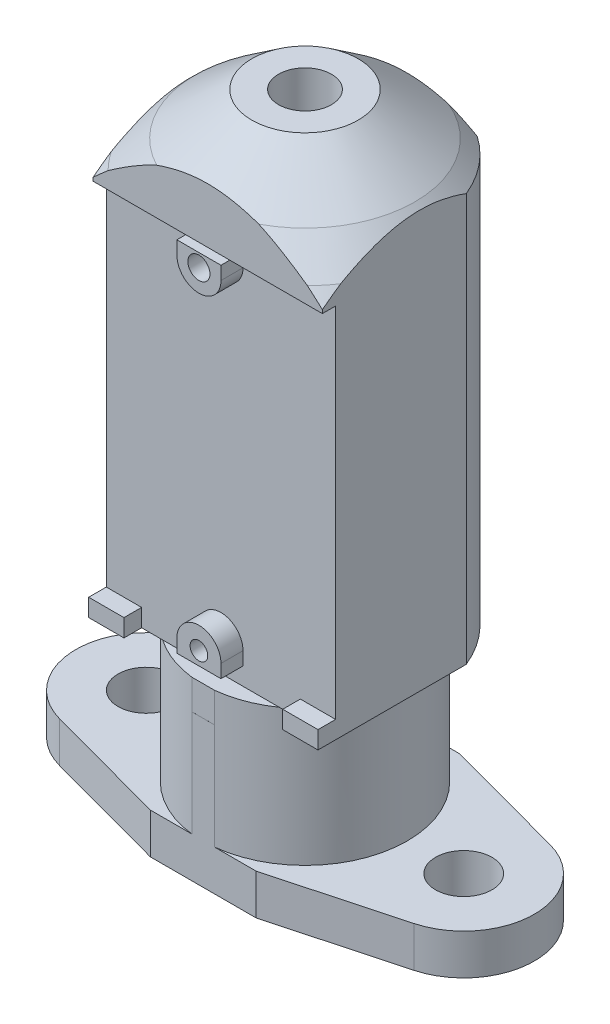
ISO-10303-21;
HEADER;
FILE_DESCRIPTION(('STEP AP214'),'2;1');
FILE_NAME('part.step','',(''),(''),'','','');
FILE_SCHEMA(('AUTOMOTIVE_DESIGN { 1 0 10303 214 1 1 1 1 }'));
ENDSEC;
DATA;
#1=APPLICATION_CONTEXT('core data for automotive mechanical design processes');
#2=APPLICATION_PROTOCOL_DEFINITION('international standard','automotive_design',2000,#1);
#3=PRODUCT_CONTEXT('',#1,'mechanical');
#4=PRODUCT('Part','Part','',(#3));
#5=PRODUCT_RELATED_PRODUCT_CATEGORY('part','',(#4));
#6=PRODUCT_DEFINITION_FORMATION('','',#4);
#7=PRODUCT_DEFINITION_CONTEXT('part definition',#1,'design');
#8=PRODUCT_DEFINITION('design','',#6,#7);
#9=PRODUCT_DEFINITION_SHAPE('','',#8);
#10=(LENGTH_UNIT() NAMED_UNIT(*) SI_UNIT(.MILLI.,.METRE.));
#11=(NAMED_UNIT(*) PLANE_ANGLE_UNIT() SI_UNIT($,.RADIAN.));
#12=(NAMED_UNIT(*) SI_UNIT($,.STERADIAN.) SOLID_ANGLE_UNIT());
#13=UNCERTAINTY_MEASURE_WITH_UNIT(LENGTH_MEASURE(1.E-05),#10,'distance_accuracy_value','');
#14=(GEOMETRIC_REPRESENTATION_CONTEXT(3) GLOBAL_UNCERTAINTY_ASSIGNED_CONTEXT((#13)) GLOBAL_UNIT_ASSIGNED_CONTEXT((#10,
#11,#12)) REPRESENTATION_CONTEXT('',''));
#15=CARTESIAN_POINT('',(0.,0.,0.));
#16=DIRECTION('',(0.,0.,1.));
#17=DIRECTION('',(1.,0.,0.));
#18=AXIS2_PLACEMENT_3D('',#15,#16,#17);
#19=CARTESIAN_POINT('',(9.,0.25,0.));
#20=DIRECTION('',(0.,-1.,0.));
#21=DIRECTION('',(1.,0.,0.));
#22=AXIS2_PLACEMENT_3D('',#19,#20,#21);
#23=CONICAL_SURFACE('',#22,1.75,0.785398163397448);
#24=CARTESIAN_POINT('',(9.,0.5,0.));
#25=DIRECTION('',(0.,1.,0.));
#26=DIRECTION('',(1.,0.,0.));
#27=AXIS2_PLACEMENT_3D('',#24,#25,#26);
#28=CIRCLE('',#27,1.5);
#29=CARTESIAN_POINT('',(7.5,0.5,0.));
#30=VERTEX_POINT('',#29);
#31=CARTESIAN_POINT('',(10.5,0.5,0.));
#32=VERTEX_POINT('',#31);
#33=EDGE_CURVE('E13',#30,#32,#28,.T.);
#34=ORIENTED_EDGE('',*,*,#33,.T.);
#35=CARTESIAN_POINT('',(9.,0.5,0.));
#36=DIRECTION('',(0.,1.,0.));
#37=DIRECTION('',(1.,0.,0.));
#38=AXIS2_PLACEMENT_3D('',#35,#36,#37);
#39=CIRCLE('',#38,1.5);
#40=EDGE_CURVE('E35',#32,#30,#39,.T.);
#41=ORIENTED_EDGE('',*,*,#40,.T.);
#42=DIRECTION('',(-0.707106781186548,-0.707106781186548,0.));
#43=VECTOR('',#42,1.);
#44=CARTESIAN_POINT('',(7.25,0.25,0.));
#45=LINE('',#44,#43);
#46=CARTESIAN_POINT('',(7.,0.,0.));
#47=VERTEX_POINT('',#46);
#48=EDGE_CURVE('E481',#30,#47,#45,.T.);
#49=ORIENTED_EDGE('',*,*,#48,.T.);
#50=CARTESIAN_POINT('',(9.,0.,0.));
#51=DIRECTION('',(0.,-1.,0.));
#52=DIRECTION('',(1.,0.,0.));
#53=AXIS2_PLACEMENT_3D('',#50,#51,#52);
#54=CIRCLE('',#53,2.);
#55=EDGE_CURVE('E544',#47,#47,#54,.T.);
#56=ORIENTED_EDGE('',*,*,#55,.T.);
#57=ORIENTED_EDGE('',*,*,#48,.F.);
#58=EDGE_LOOP('',(#34,#41,#49,#56,#57));
#59=FACE_BOUND('',#58,.T.);
#60=ADVANCED_FACE('F24',(#59),#23,.F.);
#61=CARTESIAN_POINT('',(9.,0.,0.));
#62=DIRECTION('',(0.,1.,0.));
#63=DIRECTION('',(1.,0.,0.));
#64=AXIS2_PLACEMENT_3D('',#61,#62,#63);
#65=PLANE('',#64);
#66=DIRECTION('',(0.965368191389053,0.,-0.260891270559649));
#67=VECTOR('',#66,1.);
#68=CARTESIAN_POINT('',(12.,0.,5.765));
#69=LINE('',#68,#67);
#70=CARTESIAN_POINT('',(12.,0.,5.765));
#71=VERTEX_POINT('',#70);
#72=CARTESIAN_POINT('',(19.0435650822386,0.,3.86147276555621));
#73=VERTEX_POINT('',#72);
#74=EDGE_CURVE('E676',#71,#73,#69,.T.);
#75=ORIENTED_EDGE('',*,*,#74,.F.);
#76=DIRECTION('',(-1.,0.,0.));
#77=VECTOR('',#76,1.);
#78=CARTESIAN_POINT('',(12.,0.,5.765));
#79=LINE('',#78,#77);
#80=CARTESIAN_POINT('',(6.,0.,5.765));
#81=VERTEX_POINT('',#80);
#82=EDGE_CURVE('E627',#71,#81,#79,.T.);
#83=ORIENTED_EDGE('',*,*,#82,.T.);
#84=DIRECTION('',(-0.965368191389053,0.,-0.260891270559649));
#85=VECTOR('',#84,1.);
#86=CARTESIAN_POINT('',(6.,0.,5.765));
#87=LINE('',#86,#85);
#88=CARTESIAN_POINT('',(-1.0435650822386,0.,3.86147276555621));
#89=VERTEX_POINT('',#88);
#90=EDGE_CURVE('E620',#81,#89,#87,.T.);
#91=ORIENTED_EDGE('',*,*,#90,.T.);
#92=CARTESIAN_POINT('',(0.,0.,0.));
#93=DIRECTION('',(0.,1.,0.));
#94=DIRECTION('',(1.,0.,0.));
#95=AXIS2_PLACEMENT_3D('',#92,#93,#94);
#96=CIRCLE('',#95,4.);
#97=CARTESIAN_POINT('',(-1.0435650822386,0.,-3.86147276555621));
#98=VERTEX_POINT('',#97);
#99=EDGE_CURVE('E585',#98,#89,#96,.T.);
#100=ORIENTED_EDGE('',*,*,#99,.F.);
#101=DIRECTION('',(-0.965368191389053,0.,0.260891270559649));
#102=VECTOR('',#101,1.);
#103=CARTESIAN_POINT('',(6.,0.,-5.765));
#104=LINE('',#103,#102);
#105=CARTESIAN_POINT('',(6.,0.,-5.765));
#106=VERTEX_POINT('',#105);
#107=EDGE_CURVE('E471',#106,#98,#104,.T.);
#108=ORIENTED_EDGE('',*,*,#107,.F.);
#109=DIRECTION('',(1.,0.,0.));
#110=VECTOR('',#109,1.);
#111=CARTESIAN_POINT('',(6.,0.,-5.765));
#112=LINE('',#111,#110);
#113=CARTESIAN_POINT('',(12.,0.,-5.765));
#114=VERTEX_POINT('',#113);
#115=EDGE_CURVE('E628',#106,#114,#112,.T.);
#116=ORIENTED_EDGE('',*,*,#115,.T.);
#117=DIRECTION('',(0.965368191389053,0.,0.260891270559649));
#118=VECTOR('',#117,1.);
#119=CARTESIAN_POINT('',(12.,0.,-5.765));
#120=LINE('',#119,#118);
#121=CARTESIAN_POINT('',(19.0435650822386,0.,-3.86147276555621));
#122=VERTEX_POINT('',#121);
#123=EDGE_CURVE('E667',#114,#122,#120,.T.);
#124=ORIENTED_EDGE('',*,*,#123,.T.);
#125=CARTESIAN_POINT('',(18.,0.,0.));
#126=DIRECTION('',(0.,1.,0.));
#127=DIRECTION('',(1.,0.,0.));
#128=AXIS2_PLACEMENT_3D('',#125,#126,#127);
#129=CIRCLE('',#128,4.);
#130=EDGE_CURVE('E880',#73,#122,#129,.T.);
#131=ORIENTED_EDGE('',*,*,#130,.F.);
#132=EDGE_LOOP('',(#75,#83,#91,#100,#108,#116,#124,#131));
#133=FACE_BOUND('',#132,.T.);
#134=CARTESIAN_POINT('',(18.,0.,0.));
#135=DIRECTION('',(0.,-1.,0.));
#136=DIRECTION('',(1.,0.,0.));
#137=AXIS2_PLACEMENT_3D('',#134,#135,#136);
#138=CIRCLE('',#137,1.6);
#139=CARTESIAN_POINT('',(16.4,0.,0.));
#140=VERTEX_POINT('',#139);
#141=EDGE_CURVE('E28',#140,#140,#138,.T.);
#142=ORIENTED_EDGE('',*,*,#141,.F.);
#143=EDGE_LOOP('',(#142));
#144=FACE_BOUND('',#143,.T.);
#145=CARTESIAN_POINT('',(0.,0.,0.));
#146=DIRECTION('',(0.,-1.,0.));
#147=DIRECTION('',(1.,0.,0.));
#148=AXIS2_PLACEMENT_3D('',#145,#146,#147);
#149=CIRCLE('',#148,1.6);
#150=CARTESIAN_POINT('',(-1.6,0.,0.));
#151=VERTEX_POINT('',#150);
#152=EDGE_CURVE('E647',#151,#151,#149,.T.);
#153=ORIENTED_EDGE('',*,*,#152,.F.);
#154=EDGE_LOOP('',(#153));
#155=FACE_BOUND('',#154,.T.);
#156=ORIENTED_EDGE('',*,*,#55,.F.);
#157=EDGE_LOOP('',(#156));
#158=FACE_BOUND('',#157,.T.);
#159=ADVANCED_FACE('F742',(#133,#144,#155,#158),#65,.F.);
#160=CARTESIAN_POINT('',(9.,10.,0.));
#161=DIRECTION('',(0.,1.,0.));
#162=DIRECTION('',(-1.,0.,0.));
#163=AXIS2_PLACEMENT_3D('',#160,#161,#162);
#164=CYLINDRICAL_SURFACE('',#163,1.5);
#165=CARTESIAN_POINT('',(9.,36.3,0.));
#166=DIRECTION('',(0.,-1.,0.));
#167=DIRECTION('',(-1.,0.,0.));
#168=AXIS2_PLACEMENT_3D('',#165,#166,#167);
#169=CIRCLE('',#168,1.5);
#170=CARTESIAN_POINT('',(10.5,36.3,0.));
#171=VERTEX_POINT('',#170);
#172=EDGE_CURVE('E634',#171,#171,#169,.T.);
#173=ORIENTED_EDGE('',*,*,#172,.F.);
#174=DIRECTION('',(0.,-1.,0.));
#175=VECTOR('',#174,1.);
#176=CARTESIAN_POINT('',(10.5,10.,0.));
#177=LINE('',#176,#175);
#178=EDGE_CURVE('E753',#171,#32,#177,.T.);
#179=ORIENTED_EDGE('',*,*,#178,.T.);
#180=ORIENTED_EDGE('',*,*,#33,.F.);
#181=ORIENTED_EDGE('',*,*,#40,.F.);
#182=ORIENTED_EDGE('',*,*,#178,.F.);
#183=EDGE_LOOP('',(#173,#179,#180,#181,#182));
#184=FACE_BOUND('',#183,.T.);
#185=ADVANCED_FACE('F745',(#184),#164,.F.);
#186=CARTESIAN_POINT('',(8.35478375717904,10.,6.014));
#187=DIRECTION('',(0.,0.,1.));
#188=DIRECTION('',(1.,0.,0.));
#189=AXIS2_PLACEMENT_3D('',#186,#187,#188);
#190=PLANE('',#189);
#191=DIRECTION('',(0.,-1.,0.));
#192=VECTOR('',#191,1.);
#193=CARTESIAN_POINT('',(7.75,10.875,6.014));
#194=LINE('',#193,#192);
#195=CARTESIAN_POINT('',(7.75,11.75,6.014));
#196=VERTEX_POINT('',#195);
#197=CARTESIAN_POINT('',(7.75,11.,6.014));
#198=VERTEX_POINT('',#197);
#199=EDGE_CURVE('E756',#196,#198,#194,.T.);
#200=ORIENTED_EDGE('',*,*,#199,.T.);
#201=DIRECTION('',(1.,0.,0.));
#202=VECTOR('',#201,1.);
#203=CARTESIAN_POINT('',(6.42739187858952,11.,6.014));
#204=LINE('',#203,#202);
#205=CARTESIAN_POINT('',(10.25,11.,6.014));
#206=VERTEX_POINT('',#205);
#207=EDGE_CURVE('E439',#198,#206,#204,.T.);
#208=ORIENTED_EDGE('',*,*,#207,.T.);
#209=DIRECTION('',(0.,1.,0.));
#210=VECTOR('',#209,1.);
#211=CARTESIAN_POINT('',(10.25,10.5,6.014));
#212=LINE('',#211,#210);
#213=CARTESIAN_POINT('',(10.25,11.75,6.014));
#214=VERTEX_POINT('',#213);
#215=EDGE_CURVE('E641',#206,#214,#212,.T.);
#216=ORIENTED_EDGE('',*,*,#215,.T.);
#217=CARTESIAN_POINT('',(9.,11.75,6.014));
#218=DIRECTION('',(0.,0.,1.));
#219=DIRECTION('',(1.,0.,0.));
#220=AXIS2_PLACEMENT_3D('',#217,#218,#219);
#221=CIRCLE('',#220,1.25);
#222=EDGE_CURVE('E635',#214,#196,#221,.T.);
#223=ORIENTED_EDGE('',*,*,#222,.T.);
#224=EDGE_LOOP('',(#200,#208,#216,#223));
#225=FACE_BOUND('',#224,.T.);
#226=CARTESIAN_POINT('',(9.,11.75,6.014));
#227=DIRECTION('',(0.,0.,-1.));
#228=DIRECTION('',(1.,0.,0.));
#229=AXIS2_PLACEMENT_3D('',#226,#227,#228);
#230=CIRCLE('',#229,0.5);
#231=CARTESIAN_POINT('',(8.5,11.75,6.014));
#232=VERTEX_POINT('',#231);
#233=EDGE_CURVE('E642',#232,#232,#230,.T.);
#234=ORIENTED_EDGE('',*,*,#233,.T.);
#235=EDGE_LOOP('',(#234));
#236=FACE_BOUND('',#235,.T.);
#237=ADVANCED_FACE('F1294',(#225,#236),#190,.T.);
#238=CARTESIAN_POINT('',(8.35478375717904,10.,6.014));
#239=DIRECTION('',(0.,0.,1.));
#240=DIRECTION('',(1.,0.,0.));
#241=AXIS2_PLACEMENT_3D('',#238,#239,#240);
#242=PLANE('',#241);
#243=DIRECTION('',(-1.,0.,0.));
#244=VECTOR('',#243,1.);
#245=CARTESIAN_POINT('',(11.9273918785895,31.3,6.014));
#246=LINE('',#245,#244);
#247=CARTESIAN_POINT('',(10.25,31.3,6.014));
#248=VERTEX_POINT('',#247);
#249=CARTESIAN_POINT('',(7.75,31.3,6.014));
#250=VERTEX_POINT('',#249);
#251=EDGE_CURVE('E725',#248,#250,#246,.T.);
#252=ORIENTED_EDGE('',*,*,#251,.T.);
#253=DIRECTION('',(0.,-1.,0.));
#254=VECTOR('',#253,1.);
#255=CARTESIAN_POINT('',(7.75,20.65,6.014));
#256=LINE('',#255,#254);
#257=CARTESIAN_POINT('',(7.75,30.55,6.014));
#258=VERTEX_POINT('',#257);
#259=EDGE_CURVE('E830',#250,#258,#256,.T.);
#260=ORIENTED_EDGE('',*,*,#259,.T.);
#261=CARTESIAN_POINT('',(9.,30.55,6.014));
#262=DIRECTION('',(0.,0.,1.));
#263=DIRECTION('',(-1.,0.,0.));
#264=AXIS2_PLACEMENT_3D('',#261,#262,#263);
#265=CIRCLE('',#264,1.25);
#266=CARTESIAN_POINT('',(10.25,30.55,6.014));
#267=VERTEX_POINT('',#266);
#268=EDGE_CURVE('E826',#258,#267,#265,.T.);
#269=ORIENTED_EDGE('',*,*,#268,.T.);
#270=DIRECTION('',(0.,1.,0.));
#271=VECTOR('',#270,1.);
#272=CARTESIAN_POINT('',(10.25,20.275,6.014));
#273=LINE('',#272,#271);
#274=EDGE_CURVE('E809',#267,#248,#273,.T.);
#275=ORIENTED_EDGE('',*,*,#274,.T.);
#276=EDGE_LOOP('',(#252,#260,#269,#275));
#277=FACE_BOUND('',#276,.T.);
#278=CARTESIAN_POINT('',(9.,30.55,6.014));
#279=DIRECTION('',(0.,0.,-1.));
#280=DIRECTION('',(1.,0.,0.));
#281=AXIS2_PLACEMENT_3D('',#278,#279,#280);
#282=CIRCLE('',#281,0.625);
#283=CARTESIAN_POINT('',(8.375,30.55,6.014));
#284=VERTEX_POINT('',#283);
#285=EDGE_CURVE('E805',#284,#284,#282,.T.);
#286=ORIENTED_EDGE('',*,*,#285,.T.);
#287=EDGE_LOOP('',(#286));
#288=FACE_BOUND('',#287,.T.);
#289=ADVANCED_FACE('F1295',(#277,#288),#242,.T.);
#290=CARTESIAN_POINT('',(9.,8.3,6.39039083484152));
#291=DIRECTION('',(0.,1.,0.));
#292=DIRECTION('',(1.,0.,0.));
#293=AXIS2_PLACEMENT_3D('',#290,#291,#292);
#294=PLANE('',#293);
#295=CARTESIAN_POINT('',(9.,8.3,0.));
#296=DIRECTION('',(0.,-1.,0.));
#297=DIRECTION('',(-1.,0.,0.));
#298=AXIS2_PLACEMENT_3D('',#295,#296,#297);
#299=CIRCLE('',#298,5.8);
#300=CARTESIAN_POINT('',(9.64521624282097,8.3,5.764));
#301=VERTEX_POINT('',#300);
#302=CARTESIAN_POINT('',(9.63621930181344,8.3,5.765));
#303=VERTEX_POINT('',#302);
#304=EDGE_CURVE('E773',#301,#303,#299,.T.);
#305=ORIENTED_EDGE('',*,*,#304,.F.);
#306=DIRECTION('',(1.,0.,0.));
#307=VECTOR('',#306,1.);
#308=CARTESIAN_POINT('',(15.5,8.3,5.764));
#309=LINE('',#308,#307);
#310=CARTESIAN_POINT('',(8.35478375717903,8.3,5.764));
#311=VERTEX_POINT('',#310);
#312=EDGE_CURVE('E810',#311,#301,#309,.T.);
#313=ORIENTED_EDGE('',*,*,#312,.F.);
#314=CARTESIAN_POINT('',(9.,8.3,0.));
#315=DIRECTION('',(0.,-1.,0.));
#316=DIRECTION('',(-1.,0.,0.));
#317=AXIS2_PLACEMENT_3D('',#314,#315,#316);
#318=CIRCLE('',#317,5.8);
#319=CARTESIAN_POINT('',(8.36378069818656,8.3,5.765));
#320=VERTEX_POINT('',#319);
#321=EDGE_CURVE('E568',#320,#311,#318,.T.);
#322=ORIENTED_EDGE('',*,*,#321,.F.);
#323=DIRECTION('',(-1.,0.,0.));
#324=VECTOR('',#323,1.);
#325=CARTESIAN_POINT('',(7.5,8.3,5.765));
#326=LINE('',#325,#324);
#327=EDGE_CURVE('E1035',#303,#320,#326,.T.);
#328=ORIENTED_EDGE('',*,*,#327,.F.);
#329=EDGE_LOOP('',(#305,#313,#322,#328));
#330=FACE_BOUND('',#329,.T.);
#331=ADVANCED_FACE('F1298',(#330),#294,.T.);
#332=CARTESIAN_POINT('',(4.99855913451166,36.3,5.764));
#333=DIRECTION('',(0.,0.,-1.));
#334=DIRECTION('',(0.,-1.,0.));
#335=AXIS2_PLACEMENT_3D('',#332,#333,#334);
#336=PLANE('',#335);
#337=DIRECTION('',(0.,-1.,0.));
#338=VECTOR('',#337,1.);
#339=CARTESIAN_POINT('',(9.64521624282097,2.3,5.764));
#340=LINE('',#339,#338);
#341=CARTESIAN_POINT('',(9.64521624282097,10.,5.764));
#342=VERTEX_POINT('',#341);
#343=EDGE_CURVE('E979',#342,#301,#340,.T.);
#344=ORIENTED_EDGE('',*,*,#343,.F.);
#345=DIRECTION('',(1.,0.,0.));
#346=VECTOR('',#345,1.);
#347=CARTESIAN_POINT('',(6.99927956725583,10.,5.764));
#348=LINE('',#347,#346);
#349=CARTESIAN_POINT('',(8.35478375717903,10.,5.764));
#350=VERTEX_POINT('',#349);
#351=EDGE_CURVE('E822',#350,#342,#348,.T.);
#352=ORIENTED_EDGE('',*,*,#351,.F.);
#353=DIRECTION('',(0.,1.,0.));
#354=VECTOR('',#353,1.);
#355=CARTESIAN_POINT('',(8.35478375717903,2.3,5.764));
#356=LINE('',#355,#354);
#357=EDGE_CURVE('E772',#311,#350,#356,.T.);
#358=ORIENTED_EDGE('',*,*,#357,.F.);
#359=ORIENTED_EDGE('',*,*,#312,.T.);
#360=EDGE_LOOP('',(#344,#352,#358,#359));
#361=FACE_BOUND('',#360,.T.);
#362=ADVANCED_FACE('F1229',(#361),#336,.F.);
#363=CARTESIAN_POINT('',(6.,0.,5.765));
#364=DIRECTION('',(0.,0.,1.));
#365=DIRECTION('',(1.,0.,0.));
#366=AXIS2_PLACEMENT_3D('',#363,#364,#365);
#367=PLANE('',#366);
#368=ORIENTED_EDGE('',*,*,#327,.T.);
#369=DIRECTION('',(0.,1.,0.));
#370=VECTOR('',#369,1.);
#371=CARTESIAN_POINT('',(8.36378069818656,2.3,5.765));
#372=LINE('',#371,#370);
#373=CARTESIAN_POINT('',(8.36378069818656,2.3,5.765));
#374=VERTEX_POINT('',#373);
#375=EDGE_CURVE('E768',#374,#320,#372,.T.);
#376=ORIENTED_EDGE('',*,*,#375,.F.);
#377=DIRECTION('',(1.,0.,0.));
#378=VECTOR('',#377,1.);
#379=CARTESIAN_POINT('',(12.,2.3,5.765));
#380=LINE('',#379,#378);
#381=CARTESIAN_POINT('',(6.,2.3,5.765));
#382=VERTEX_POINT('',#381);
#383=EDGE_CURVE('E684',#382,#374,#380,.T.);
#384=ORIENTED_EDGE('',*,*,#383,.F.);
#385=DIRECTION('',(0.,1.,0.));
#386=VECTOR('',#385,1.);
#387=CARTESIAN_POINT('',(6.,0.,5.765));
#388=LINE('',#387,#386);
#389=EDGE_CURVE('E1066',#81,#382,#388,.T.);
#390=ORIENTED_EDGE('',*,*,#389,.F.);
#391=ORIENTED_EDGE('',*,*,#82,.F.);
#392=DIRECTION('',(0.,1.,0.));
#393=VECTOR('',#392,1.);
#394=CARTESIAN_POINT('',(12.,0.,5.765));
#395=LINE('',#394,#393);
#396=CARTESIAN_POINT('',(12.,2.3,5.765));
#397=VERTEX_POINT('',#396);
#398=EDGE_CURVE('E567',#71,#397,#395,.T.);
#399=ORIENTED_EDGE('',*,*,#398,.T.);
#400=DIRECTION('',(1.,0.,0.));
#401=VECTOR('',#400,1.);
#402=CARTESIAN_POINT('',(12.,2.3,5.765));
#403=LINE('',#402,#401);
#404=CARTESIAN_POINT('',(9.63621930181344,2.3,5.765));
#405=VERTEX_POINT('',#404);
#406=EDGE_CURVE('E477',#405,#397,#403,.T.);
#407=ORIENTED_EDGE('',*,*,#406,.F.);
#408=DIRECTION('',(0.,1.,0.));
#409=VECTOR('',#408,1.);
#410=CARTESIAN_POINT('',(9.63621930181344,2.3,5.765));
#411=LINE('',#410,#409);
#412=EDGE_CURVE('E563',#405,#303,#411,.T.);
#413=ORIENTED_EDGE('',*,*,#412,.T.);
#414=EDGE_LOOP('',(#368,#376,#384,#390,#391,#399,#407,#413));
#415=FACE_BOUND('',#414,.T.);
#416=ADVANCED_FACE('F1032',(#415),#367,.T.);
#417=CARTESIAN_POINT('',(9.,2.3,0.));
#418=DIRECTION('',(0.,1.,0.));
#419=DIRECTION('',(-1.,0.,0.));
#420=AXIS2_PLACEMENT_3D('',#417,#418,#419);
#421=CYLINDRICAL_SURFACE('',#420,5.8);
#422=ORIENTED_EDGE('',*,*,#321,.T.);
#423=ORIENTED_EDGE('',*,*,#357,.T.);
#424=CARTESIAN_POINT('',(9.,10.,0.));
#425=DIRECTION('',(0.,1.,0.));
#426=DIRECTION('',(-1.,0.,0.));
#427=AXIS2_PLACEMENT_3D('',#424,#425,#426);
#428=CIRCLE('',#427,5.8);
#429=CARTESIAN_POINT('',(5.69178235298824,10.,4.764));
#430=VERTEX_POINT('',#429);
#431=EDGE_CURVE('E817',#430,#350,#428,.T.);
#432=ORIENTED_EDGE('',*,*,#431,.F.);
#433=CARTESIAN_POINT('',(9.,10.,0.));
#434=DIRECTION('',(0.,1.,0.));
#435=DIRECTION('',(-1.,0.,0.));
#436=AXIS2_PLACEMENT_3D('',#433,#434,#435);
#437=CIRCLE('',#436,5.8);
#438=CARTESIAN_POINT('',(8.36378069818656,10.,-5.765));
#439=VERTEX_POINT('',#438);
#440=EDGE_CURVE('E657',#439,#430,#437,.T.);
#441=ORIENTED_EDGE('',*,*,#440,.F.);
#442=DIRECTION('',(0.,1.,0.));
#443=VECTOR('',#442,1.);
#444=CARTESIAN_POINT('',(8.36378069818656,2.3,-5.765));
#445=LINE('',#444,#443);
#446=CARTESIAN_POINT('',(8.36378069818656,2.3,-5.765));
#447=VERTEX_POINT('',#446);
#448=EDGE_CURVE('E539',#447,#439,#445,.T.);
#449=ORIENTED_EDGE('',*,*,#448,.F.);
#450=CARTESIAN_POINT('',(9.,2.3,0.));
#451=DIRECTION('',(0.,-1.,0.));
#452=DIRECTION('',(-1.,0.,0.));
#453=AXIS2_PLACEMENT_3D('',#450,#451,#452);
#454=CIRCLE('',#453,5.8);
#455=EDGE_CURVE('E918',#374,#447,#454,.T.);
#456=ORIENTED_EDGE('',*,*,#455,.F.);
#457=ORIENTED_EDGE('',*,*,#375,.T.);
#458=EDGE_LOOP('',(#422,#423,#432,#441,#449,#456,#457));
#459=FACE_BOUND('',#458,.T.);
#460=ADVANCED_FACE('F1144',(#459),#421,.T.);
#461=CARTESIAN_POINT('',(9.,2.3,0.));
#462=DIRECTION('',(0.,1.,0.));
#463=DIRECTION('',(1.,0.,0.));
#464=AXIS2_PLACEMENT_3D('',#461,#462,#463);
#465=CYLINDRICAL_SURFACE('',#464,5.8);
#466=ORIENTED_EDGE('',*,*,#304,.T.);
#467=ORIENTED_EDGE('',*,*,#412,.F.);
#468=CARTESIAN_POINT('',(9.,2.3,0.));
#469=DIRECTION('',(0.,-1.,0.));
#470=DIRECTION('',(-1.,0.,0.));
#471=AXIS2_PLACEMENT_3D('',#468,#469,#470);
#472=CIRCLE('',#471,5.8);
#473=CARTESIAN_POINT('',(9.63621930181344,2.3,-5.765));
#474=VERTEX_POINT('',#473);
#475=EDGE_CURVE('E496',#474,#405,#472,.T.);
#476=ORIENTED_EDGE('',*,*,#475,.F.);
#477=DIRECTION('',(0.,1.,0.));
#478=VECTOR('',#477,1.);
#479=CARTESIAN_POINT('',(9.63621930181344,2.3,-5.765));
#480=LINE('',#479,#478);
#481=CARTESIAN_POINT('',(9.63621930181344,10.,-5.765));
#482=VERTEX_POINT('',#481);
#483=EDGE_CURVE('E904',#474,#482,#480,.T.);
#484=ORIENTED_EDGE('',*,*,#483,.T.);
#485=CARTESIAN_POINT('',(9.,10.,0.));
#486=DIRECTION('',(0.,1.,0.));
#487=DIRECTION('',(-1.,0.,0.));
#488=AXIS2_PLACEMENT_3D('',#485,#486,#487);
#489=CIRCLE('',#488,5.8);
#490=CARTESIAN_POINT('',(12.3082176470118,10.,4.764));
#491=VERTEX_POINT('',#490);
#492=EDGE_CURVE('E652',#491,#482,#489,.T.);
#493=ORIENTED_EDGE('',*,*,#492,.F.);
#494=CARTESIAN_POINT('',(9.,10.,0.));
#495=DIRECTION('',(0.,1.,0.));
#496=DIRECTION('',(-1.,0.,0.));
#497=AXIS2_PLACEMENT_3D('',#494,#495,#496);
#498=CIRCLE('',#497,5.8);
#499=EDGE_CURVE('E847',#342,#491,#498,.T.);
#500=ORIENTED_EDGE('',*,*,#499,.F.);
#501=ORIENTED_EDGE('',*,*,#343,.T.);
#502=EDGE_LOOP('',(#466,#467,#476,#484,#493,#500,#501));
#503=FACE_BOUND('',#502,.T.);
#504=ADVANCED_FACE('F1137',(#503),#465,.T.);
#505=CARTESIAN_POINT('',(9.,10.,0.));
#506=DIRECTION('',(0.,1.,0.));
#507=DIRECTION('',(1.,0.,0.));
#508=AXIS2_PLACEMENT_3D('',#505,#506,#507);
#509=PLANE('',#508);
#510=DIRECTION('',(-1.,0.,0.));
#511=VECTOR('',#510,1.);
#512=CARTESIAN_POINT('',(9.,10.,4.764));
#513=LINE('',#512,#511);
#514=EDGE_CURVE('E821',#491,#430,#513,.T.);
#515=ORIENTED_EDGE('',*,*,#514,.T.);
#516=ORIENTED_EDGE('',*,*,#431,.T.);
#517=ORIENTED_EDGE('',*,*,#351,.T.);
#518=ORIENTED_EDGE('',*,*,#499,.T.);
#519=EDGE_LOOP('',(#515,#516,#517,#518));
#520=FACE_BOUND('',#519,.T.);
#521=ADVANCED_FACE('F969',(#520),#509,.T.);
#522=CARTESIAN_POINT('',(9.,2.3,0.));
#523=DIRECTION('',(0.,1.,0.));
#524=DIRECTION('',(1.,0.,0.));
#525=AXIS2_PLACEMENT_3D('',#522,#523,#524);
#526=PLANE('',#525);
#527=ORIENTED_EDGE('',*,*,#455,.T.);
#528=DIRECTION('',(-1.,0.,0.));
#529=VECTOR('',#528,1.);
#530=CARTESIAN_POINT('',(6.,2.3,-5.765));
#531=LINE('',#530,#529);
#532=CARTESIAN_POINT('',(6.,2.3,-5.765));
#533=VERTEX_POINT('',#532);
#534=EDGE_CURVE('E610',#447,#533,#531,.T.);
#535=ORIENTED_EDGE('',*,*,#534,.T.);
#536=DIRECTION('',(-0.965368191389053,0.,0.260891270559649));
#537=VECTOR('',#536,1.);
#538=CARTESIAN_POINT('',(6.,2.3,-5.765));
#539=LINE('',#538,#537);
#540=CARTESIAN_POINT('',(-1.0435650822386,2.3,-3.86147276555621));
#541=VERTEX_POINT('',#540);
#542=EDGE_CURVE('E606',#533,#541,#539,.T.);
#543=ORIENTED_EDGE('',*,*,#542,.T.);
#544=CARTESIAN_POINT('',(0.,2.3,0.));
#545=DIRECTION('',(0.,1.,0.));
#546=DIRECTION('',(1.,0.,0.));
#547=AXIS2_PLACEMENT_3D('',#544,#545,#546);
#548=CIRCLE('',#547,4.);
#549=CARTESIAN_POINT('',(-1.0435650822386,2.3,3.86147276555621));
#550=VERTEX_POINT('',#549);
#551=EDGE_CURVE('E611',#541,#550,#548,.T.);
#552=ORIENTED_EDGE('',*,*,#551,.T.);
#553=DIRECTION('',(0.965368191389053,0.,0.260891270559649));
#554=VECTOR('',#553,1.);
#555=CARTESIAN_POINT('',(6.,2.3,5.765));
#556=LINE('',#555,#554);
#557=EDGE_CURVE('E687',#550,#382,#556,.T.);
#558=ORIENTED_EDGE('',*,*,#557,.T.);
#559=ORIENTED_EDGE('',*,*,#383,.T.);
#560=EDGE_LOOP('',(#527,#535,#543,#552,#558,#559));
#561=FACE_BOUND('',#560,.T.);
#562=CARTESIAN_POINT('',(0.,2.3,0.));
#563=DIRECTION('',(0.,-1.,0.));
#564=DIRECTION('',(1.,0.,0.));
#565=AXIS2_PLACEMENT_3D('',#562,#563,#564);
#566=CIRCLE('',#565,1.6);
#567=CARTESIAN_POINT('',(-1.6,2.3,0.));
#568=VERTEX_POINT('',#567);
#569=EDGE_CURVE('E688',#568,#568,#566,.T.);
#570=ORIENTED_EDGE('',*,*,#569,.T.);
#571=EDGE_LOOP('',(#570));
#572=FACE_BOUND('',#571,.T.);
#573=ADVANCED_FACE('F1149',(#561,#572),#526,.T.);
#574=CARTESIAN_POINT('',(18.,0.,0.));
#575=DIRECTION('',(0.,1.,0.));
#576=DIRECTION('',(1.,0.,0.));
#577=AXIS2_PLACEMENT_3D('',#574,#575,#576);
#578=CYLINDRICAL_SURFACE('',#577,1.6);
#579=CARTESIAN_POINT('',(18.,2.3,0.));
#580=DIRECTION('',(0.,-1.,0.));
#581=DIRECTION('',(1.,0.,0.));
#582=AXIS2_PLACEMENT_3D('',#579,#580,#581);
#583=CIRCLE('',#582,1.6);
#584=CARTESIAN_POINT('',(16.4,2.3,0.));
#585=VERTEX_POINT('',#584);
#586=EDGE_CURVE('E668',#585,#585,#583,.T.);
#587=ORIENTED_EDGE('',*,*,#586,.F.);
#588=DIRECTION('',(0.,-1.,0.));
#589=VECTOR('',#588,1.);
#590=CARTESIAN_POINT('',(16.4,0.,0.));
#591=LINE('',#590,#589);
#592=EDGE_CURVE('E726',#585,#140,#591,.T.);
#593=ORIENTED_EDGE('',*,*,#592,.T.);
#594=ORIENTED_EDGE('',*,*,#141,.T.);
#595=ORIENTED_EDGE('',*,*,#592,.F.);
#596=EDGE_LOOP('',(#587,#593,#594,#595));
#597=FACE_BOUND('',#596,.T.);
#598=ADVANCED_FACE('F740',(#597),#578,.F.);
#599=CARTESIAN_POINT('',(0.,0.,0.));
#600=DIRECTION('',(0.,1.,0.));
#601=DIRECTION('',(1.,0.,0.));
#602=AXIS2_PLACEMENT_3D('',#599,#600,#601);
#603=CYLINDRICAL_SURFACE('',#602,1.6);
#604=ORIENTED_EDGE('',*,*,#569,.F.);
#605=DIRECTION('',(0.,-1.,0.));
#606=VECTOR('',#605,1.);
#607=CARTESIAN_POINT('',(-1.6,0.,0.));
#608=LINE('',#607,#606);
#609=EDGE_CURVE('E643',#568,#151,#608,.T.);
#610=ORIENTED_EDGE('',*,*,#609,.T.);
#611=ORIENTED_EDGE('',*,*,#152,.T.);
#612=ORIENTED_EDGE('',*,*,#609,.F.);
#613=EDGE_LOOP('',(#604,#610,#611,#612));
#614=FACE_BOUND('',#613,.T.);
#615=ADVANCED_FACE('F1246',(#614),#603,.F.);
#616=CARTESIAN_POINT('',(-1.0435650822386,0.,3.86147276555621));
#617=DIRECTION('',(-0.260891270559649,0.,0.965368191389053));
#618=DIRECTION('',(0.,1.,0.));
#619=AXIS2_PLACEMENT_3D('',#616,#617,#618);
#620=PLANE('',#619);
#621=ORIENTED_EDGE('',*,*,#90,.F.);
#622=ORIENTED_EDGE('',*,*,#389,.T.);
#623=ORIENTED_EDGE('',*,*,#557,.F.);
#624=DIRECTION('',(0.,1.,0.));
#625=VECTOR('',#624,1.);
#626=CARTESIAN_POINT('',(-1.0435650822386,0.,3.86147276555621));
#627=LINE('',#626,#625);
#628=EDGE_CURVE('E581',#89,#550,#627,.T.);
#629=ORIENTED_EDGE('',*,*,#628,.F.);
#630=EDGE_LOOP('',(#621,#622,#623,#629));
#631=FACE_BOUND('',#630,.T.);
#632=ADVANCED_FACE('F1165',(#631),#620,.T.);
#633=CARTESIAN_POINT('',(0.,0.,0.));
#634=DIRECTION('',(0.,1.,0.));
#635=DIRECTION('',(-1.,0.,0.));
#636=AXIS2_PLACEMENT_3D('',#633,#634,#635);
#637=CYLINDRICAL_SURFACE('',#636,4.);
#638=ORIENTED_EDGE('',*,*,#99,.T.);
#639=ORIENTED_EDGE('',*,*,#628,.T.);
#640=ORIENTED_EDGE('',*,*,#551,.F.);
#641=DIRECTION('',(0.,1.,0.));
#642=VECTOR('',#641,1.);
#643=CARTESIAN_POINT('',(-1.0435650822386,0.,-3.86147276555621));
#644=LINE('',#643,#642);
#645=EDGE_CURVE('E707',#98,#541,#644,.T.);
#646=ORIENTED_EDGE('',*,*,#645,.F.);
#647=EDGE_LOOP('',(#638,#639,#640,#646));
#648=FACE_BOUND('',#647,.T.);
#649=ADVANCED_FACE('F1163',(#648),#637,.T.);
#650=CARTESIAN_POINT('',(6.,0.,-5.765));
#651=DIRECTION('',(-0.260891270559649,0.,-0.965368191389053));
#652=DIRECTION('',(-0.965368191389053,0.,0.260891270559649));
#653=AXIS2_PLACEMENT_3D('',#650,#651,#652);
#654=PLANE('',#653);
#655=ORIENTED_EDGE('',*,*,#107,.T.);
#656=ORIENTED_EDGE('',*,*,#645,.T.);
#657=ORIENTED_EDGE('',*,*,#542,.F.);
#658=DIRECTION('',(0.,1.,0.));
#659=VECTOR('',#658,1.);
#660=CARTESIAN_POINT('',(6.,0.,-5.765));
#661=LINE('',#660,#659);
#662=EDGE_CURVE('E536',#106,#533,#661,.T.);
#663=ORIENTED_EDGE('',*,*,#662,.F.);
#664=EDGE_LOOP('',(#655,#656,#657,#663));
#665=FACE_BOUND('',#664,.T.);
#666=ADVANCED_FACE('F1157',(#665),#654,.T.);
#667=CARTESIAN_POINT('',(19.0435650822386,0.,-3.86147276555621));
#668=DIRECTION('',(0.260891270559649,0.,-0.965368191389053));
#669=DIRECTION('',(0.,-1.,0.));
#670=AXIS2_PLACEMENT_3D('',#667,#668,#669);
#671=PLANE('',#670);
#672=ORIENTED_EDGE('',*,*,#123,.F.);
#673=DIRECTION('',(0.,1.,0.));
#674=VECTOR('',#673,1.);
#675=CARTESIAN_POINT('',(12.,0.,-5.765));
#676=LINE('',#675,#674);
#677=CARTESIAN_POINT('',(12.,2.3,-5.765));
#678=VERTEX_POINT('',#677);
#679=EDGE_CURVE('E711',#114,#678,#676,.T.);
#680=ORIENTED_EDGE('',*,*,#679,.T.);
#681=DIRECTION('',(-0.965368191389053,0.,-0.260891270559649));
#682=VECTOR('',#681,1.);
#683=CARTESIAN_POINT('',(12.,2.3,-5.765));
#684=LINE('',#683,#682);
#685=CARTESIAN_POINT('',(19.0435650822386,2.3,-3.86147276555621));
#686=VERTEX_POINT('',#685);
#687=EDGE_CURVE('E695',#686,#678,#684,.T.);
#688=ORIENTED_EDGE('',*,*,#687,.F.);
#689=DIRECTION('',(0.,1.,0.));
#690=VECTOR('',#689,1.);
#691=CARTESIAN_POINT('',(19.0435650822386,0.,-3.86147276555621));
#692=LINE('',#691,#690);
#693=EDGE_CURVE('E679',#122,#686,#692,.T.);
#694=ORIENTED_EDGE('',*,*,#693,.F.);
#695=EDGE_LOOP('',(#672,#680,#688,#694));
#696=FACE_BOUND('',#695,.T.);
#697=ADVANCED_FACE('F1128',(#696),#671,.T.);
#698=CARTESIAN_POINT('',(18.,0.,0.));
#699=DIRECTION('',(0.,1.,0.));
#700=DIRECTION('',(1.,0.,0.));
#701=AXIS2_PLACEMENT_3D('',#698,#699,#700);
#702=CYLINDRICAL_SURFACE('',#701,4.);
#703=ORIENTED_EDGE('',*,*,#130,.T.);
#704=ORIENTED_EDGE('',*,*,#693,.T.);
#705=CARTESIAN_POINT('',(18.,2.3,0.));
#706=DIRECTION('',(0.,1.,0.));
#707=DIRECTION('',(1.,0.,0.));
#708=AXIS2_PLACEMENT_3D('',#705,#706,#707);
#709=CIRCLE('',#708,4.);
#710=CARTESIAN_POINT('',(19.0435650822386,2.3,3.86147276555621));
#711=VERTEX_POINT('',#710);
#712=EDGE_CURVE('E478',#711,#686,#709,.T.);
#713=ORIENTED_EDGE('',*,*,#712,.F.);
#714=DIRECTION('',(0.,1.,0.));
#715=VECTOR('',#714,1.);
#716=CARTESIAN_POINT('',(19.0435650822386,0.,3.86147276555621));
#717=LINE('',#716,#715);
#718=EDGE_CURVE('E680',#73,#711,#717,.T.);
#719=ORIENTED_EDGE('',*,*,#718,.F.);
#720=EDGE_LOOP('',(#703,#704,#713,#719));
#721=FACE_BOUND('',#720,.T.);
#722=ADVANCED_FACE('F1123',(#721),#702,.T.);
#723=CARTESIAN_POINT('',(12.,0.,5.765));
#724=DIRECTION('',(0.260891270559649,0.,0.965368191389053));
#725=DIRECTION('',(0.,-1.,0.));
#726=AXIS2_PLACEMENT_3D('',#723,#724,#725);
#727=PLANE('',#726);
#728=ORIENTED_EDGE('',*,*,#74,.T.);
#729=ORIENTED_EDGE('',*,*,#718,.T.);
#730=DIRECTION('',(0.965368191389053,0.,-0.260891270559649));
#731=VECTOR('',#730,1.);
#732=CARTESIAN_POINT('',(12.,2.3,5.765));
#733=LINE('',#732,#731);
#734=EDGE_CURVE('E473',#397,#711,#733,.T.);
#735=ORIENTED_EDGE('',*,*,#734,.F.);
#736=ORIENTED_EDGE('',*,*,#398,.F.);
#737=EDGE_LOOP('',(#728,#729,#735,#736));
#738=FACE_BOUND('',#737,.T.);
#739=ADVANCED_FACE('F1019',(#738),#727,.T.);
#740=CARTESIAN_POINT('',(9.,2.3,0.));
#741=DIRECTION('',(0.,1.,0.));
#742=DIRECTION('',(1.,0.,0.));
#743=AXIS2_PLACEMENT_3D('',#740,#741,#742);
#744=PLANE('',#743);
#745=ORIENTED_EDGE('',*,*,#475,.T.);
#746=ORIENTED_EDGE('',*,*,#406,.T.);
#747=ORIENTED_EDGE('',*,*,#734,.T.);
#748=ORIENTED_EDGE('',*,*,#712,.T.);
#749=ORIENTED_EDGE('',*,*,#687,.T.);
#750=DIRECTION('',(-1.,0.,0.));
#751=VECTOR('',#750,1.);
#752=CARTESIAN_POINT('',(6.,2.3,-5.765));
#753=LINE('',#752,#751);
#754=EDGE_CURVE('E672',#678,#474,#753,.T.);
#755=ORIENTED_EDGE('',*,*,#754,.T.);
#756=EDGE_LOOP('',(#745,#746,#747,#748,#749,#755));
#757=FACE_BOUND('',#756,.T.);
#758=ORIENTED_EDGE('',*,*,#586,.T.);
#759=EDGE_LOOP('',(#758));
#760=FACE_BOUND('',#759,.T.);
#761=ADVANCED_FACE('F1024',(#757,#760),#744,.T.);
#762=CARTESIAN_POINT('',(9.,10.,0.));
#763=DIRECTION('',(0.,1.,0.));
#764=DIRECTION('',(1.,0.,0.));
#765=AXIS2_PLACEMENT_3D('',#762,#763,#764);
#766=PLANE('',#765);
#767=ORIENTED_EDGE('',*,*,#492,.T.);
#768=DIRECTION('',(1.,0.,0.));
#769=VECTOR('',#768,1.);
#770=CARTESIAN_POINT('',(11.,10.,-5.765));
#771=LINE('',#770,#769);
#772=CARTESIAN_POINT('',(13.,10.,-5.765));
#773=VERTEX_POINT('',#772);
#774=EDGE_CURVE('E648',#482,#773,#771,.T.);
#775=ORIENTED_EDGE('',*,*,#774,.T.);
#776=CARTESIAN_POINT('',(9.,10.,0.));
#777=DIRECTION('',(0.,1.,0.));
#778=DIRECTION('',(0.926350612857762,0.,0.376662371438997));
#779=AXIS2_PLACEMENT_3D('',#776,#777,#778);
#780=CIRCLE('',#779,7.01678166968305);
#781=CARTESIAN_POINT('',(15.5,10.,-2.64295762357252));
#782=VERTEX_POINT('',#781);
#783=EDGE_CURVE('E782',#782,#773,#780,.T.);
#784=ORIENTED_EDGE('',*,*,#783,.F.);
#785=DIRECTION('',(0.,0.,1.));
#786=VECTOR('',#785,1.);
#787=CARTESIAN_POINT('',(15.5,10.,1.32147881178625));
#788=LINE('',#787,#786);
#789=CARTESIAN_POINT('',(15.5,10.,5.764));
#790=VERTEX_POINT('',#789);
#791=EDGE_CURVE('E486',#782,#790,#788,.T.);
#792=ORIENTED_EDGE('',*,*,#791,.T.);
#793=DIRECTION('',(-1.,0.,0.));
#794=VECTOR('',#793,1.);
#795=CARTESIAN_POINT('',(15.5,10.,5.764));
#796=LINE('',#795,#794);
#797=CARTESIAN_POINT('',(13.5,10.,5.764));
#798=VERTEX_POINT('',#797);
#799=EDGE_CURVE('E482',#790,#798,#796,.T.);
#800=ORIENTED_EDGE('',*,*,#799,.T.);
#801=DIRECTION('',(0.,0.,-1.));
#802=VECTOR('',#801,1.);
#803=CARTESIAN_POINT('',(13.5,10.,2.882));
#804=LINE('',#803,#802);
#805=CARTESIAN_POINT('',(13.5,10.,4.764));
#806=VERTEX_POINT('',#805);
#807=EDGE_CURVE('E487',#798,#806,#804,.T.);
#808=ORIENTED_EDGE('',*,*,#807,.T.);
#809=DIRECTION('',(-1.,0.,0.));
#810=VECTOR('',#809,1.);
#811=CARTESIAN_POINT('',(9.,10.,4.764));
#812=LINE('',#811,#810);
#813=EDGE_CURVE('E653',#806,#491,#812,.T.);
#814=ORIENTED_EDGE('',*,*,#813,.T.);
#815=EDGE_LOOP('',(#767,#775,#784,#792,#800,#808,#814));
#816=FACE_BOUND('',#815,.T.);
#817=ADVANCED_FACE('F982',(#816),#766,.F.);
#818=CARTESIAN_POINT('',(9.,10.,0.));
#819=DIRECTION('',(0.,1.,0.));
#820=DIRECTION('',(1.,0.,0.));
#821=AXIS2_PLACEMENT_3D('',#818,#819,#820);
#822=PLANE('',#821);
#823=ORIENTED_EDGE('',*,*,#440,.T.);
#824=DIRECTION('',(-1.,0.,0.));
#825=VECTOR('',#824,1.);
#826=CARTESIAN_POINT('',(9.,10.,4.764));
#827=LINE('',#826,#825);
#828=CARTESIAN_POINT('',(4.5,10.,4.764));
#829=VERTEX_POINT('',#828);
#830=EDGE_CURVE('E702',#430,#829,#827,.T.);
#831=ORIENTED_EDGE('',*,*,#830,.T.);
#832=DIRECTION('',(0.,0.,1.));
#833=VECTOR('',#832,1.);
#834=CARTESIAN_POINT('',(4.5,10.,2.882));
#835=LINE('',#834,#833);
#836=CARTESIAN_POINT('',(4.5,10.,5.764));
#837=VERTEX_POINT('',#836);
#838=EDGE_CURVE('E706',#829,#837,#835,.T.);
#839=ORIENTED_EDGE('',*,*,#838,.T.);
#840=DIRECTION('',(-1.,0.,0.));
#841=VECTOR('',#840,1.);
#842=CARTESIAN_POINT('',(15.5,10.,5.764));
#843=LINE('',#842,#841);
#844=CARTESIAN_POINT('',(2.5,10.,5.764));
#845=VERTEX_POINT('',#844);
#846=EDGE_CURVE('E492',#837,#845,#843,.T.);
#847=ORIENTED_EDGE('',*,*,#846,.T.);
#848=DIRECTION('',(0.,0.,-1.));
#849=VECTOR('',#848,1.);
#850=CARTESIAN_POINT('',(2.5,10.,-1.32147881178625));
#851=LINE('',#850,#849);
#852=CARTESIAN_POINT('',(2.5,10.,-2.64295762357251));
#853=VERTEX_POINT('',#852);
#854=EDGE_CURVE('E488',#845,#853,#851,.T.);
#855=ORIENTED_EDGE('',*,*,#854,.T.);
#856=CARTESIAN_POINT('',(9.,10.,0.));
#857=DIRECTION('',(0.,1.,0.));
#858=DIRECTION('',(0.926350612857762,0.,0.376662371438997));
#859=AXIS2_PLACEMENT_3D('',#856,#857,#858);
#860=CIRCLE('',#859,7.01678166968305);
#861=CARTESIAN_POINT('',(5.,10.,-5.765));
#862=VERTEX_POINT('',#861);
#863=EDGE_CURVE('E520',#862,#853,#860,.T.);
#864=ORIENTED_EDGE('',*,*,#863,.F.);
#865=DIRECTION('',(1.,0.,0.));
#866=VECTOR('',#865,1.);
#867=CARTESIAN_POINT('',(11.,10.,-5.765));
#868=LINE('',#867,#866);
#869=EDGE_CURVE('E493',#862,#439,#868,.T.);
#870=ORIENTED_EDGE('',*,*,#869,.T.);
#871=EDGE_LOOP('',(#823,#831,#839,#847,#855,#864,#870));
#872=FACE_BOUND('',#871,.T.);
#873=ADVANCED_FACE('F1173',(#872),#822,.F.);
#874=CARTESIAN_POINT('',(9.,30.55,5.764));
#875=DIRECTION('',(0.,0.,-1.));
#876=DIRECTION('',(1.,0.,0.));
#877=AXIS2_PLACEMENT_3D('',#874,#875,#876);
#878=CYLINDRICAL_SURFACE('',#877,0.625);
#879=ORIENTED_EDGE('',*,*,#285,.F.);
#880=DIRECTION('',(0.,0.,-1.));
#881=VECTOR('',#880,1.);
#882=CARTESIAN_POINT('',(8.375,30.55,5.764));
#883=LINE('',#882,#881);
#884=CARTESIAN_POINT('',(8.375,30.55,3.764));
#885=VERTEX_POINT('',#884);
#886=EDGE_CURVE('E559',#284,#885,#883,.T.);
#887=ORIENTED_EDGE('',*,*,#886,.T.);
#888=CARTESIAN_POINT('',(9.,30.55,3.764));
#889=DIRECTION('',(0.,0.,-1.));
#890=DIRECTION('',(1.,0.,0.));
#891=AXIS2_PLACEMENT_3D('',#888,#889,#890);
#892=CIRCLE('',#891,0.625);
#893=EDGE_CURVE('E552',#885,#885,#892,.T.);
#894=ORIENTED_EDGE('',*,*,#893,.T.);
#895=ORIENTED_EDGE('',*,*,#886,.F.);
#896=EDGE_LOOP('',(#879,#887,#894,#895));
#897=FACE_BOUND('',#896,.T.);
#898=ADVANCED_FACE('F1454',(#897),#878,.F.);
#899=CARTESIAN_POINT('',(9.,30.55,3.764));
#900=DIRECTION('',(0.,0.,1.));
#901=DIRECTION('',(1.,0.,0.));
#902=AXIS2_PLACEMENT_3D('',#899,#900,#901);
#903=PLANE('',#902);
#904=ORIENTED_EDGE('',*,*,#893,.F.);
#905=EDGE_LOOP('',(#904));
#906=FACE_BOUND('',#905,.T.);
#907=ADVANCED_FACE('F1285',(#906),#903,.T.);
#908=CARTESIAN_POINT('',(9.,11.75,5.764));
#909=DIRECTION('',(0.,0.,-1.));
#910=DIRECTION('',(1.,0.,0.));
#911=AXIS2_PLACEMENT_3D('',#908,#909,#910);
#912=CYLINDRICAL_SURFACE('',#911,0.5);
#913=ORIENTED_EDGE('',*,*,#233,.F.);
#914=DIRECTION('',(0.,0.,-1.));
#915=VECTOR('',#914,1.);
#916=CARTESIAN_POINT('',(8.5,11.75,5.764));
#917=LINE('',#916,#915);
#918=CARTESIAN_POINT('',(8.5,11.75,3.764));
#919=VERTEX_POINT('',#918);
#920=EDGE_CURVE('E560',#232,#919,#917,.T.);
#921=ORIENTED_EDGE('',*,*,#920,.T.);
#922=CARTESIAN_POINT('',(9.,11.75,3.764));
#923=DIRECTION('',(0.,0.,-1.));
#924=DIRECTION('',(1.,0.,0.));
#925=AXIS2_PLACEMENT_3D('',#922,#923,#924);
#926=CIRCLE('',#925,0.5);
#927=EDGE_CURVE('E339',#919,#919,#926,.T.);
#928=ORIENTED_EDGE('',*,*,#927,.T.);
#929=ORIENTED_EDGE('',*,*,#920,.F.);
#930=EDGE_LOOP('',(#913,#921,#928,#929));
#931=FACE_BOUND('',#930,.T.);
#932=ADVANCED_FACE('F1243',(#931),#912,.F.);
#933=CARTESIAN_POINT('',(9.,11.75,3.764));
#934=DIRECTION('',(0.,0.,1.));
#935=DIRECTION('',(1.,0.,0.));
#936=AXIS2_PLACEMENT_3D('',#933,#934,#935);
#937=PLANE('',#936);
#938=ORIENTED_EDGE('',*,*,#927,.F.);
#939=EDGE_LOOP('',(#938));
#940=FACE_BOUND('',#939,.T.);
#941=ADVANCED_FACE('F1240',(#940),#937,.T.);
#942=CARTESIAN_POINT('',(15.5,31.3,5.764));
#943=DIRECTION('',(0.,-1.,0.));
#944=DIRECTION('',(0.,0.,-1.));
#945=AXIS2_PLACEMENT_3D('',#942,#943,#944);
#946=PLANE('',#945);
#947=DIRECTION('',(0.,0.,-1.));
#948=VECTOR('',#947,1.);
#949=CARTESIAN_POINT('',(10.25,31.3,5.764));
#950=LINE('',#949,#948);
#951=CARTESIAN_POINT('',(10.25,31.3,5.514));
#952=VERTEX_POINT('',#951);
#953=EDGE_CURVE('E675',#248,#952,#950,.T.);
#954=ORIENTED_EDGE('',*,*,#953,.T.);
#955=DIRECTION('',(-1.,0.,0.));
#956=VECTOR('',#955,1.);
#957=CARTESIAN_POINT('',(2.5,31.3,5.514));
#958=LINE('',#957,#956);
#959=CARTESIAN_POINT('',(7.75,31.3,5.514));
#960=VERTEX_POINT('',#959);
#961=EDGE_CURVE('E884',#952,#960,#958,.T.);
#962=ORIENTED_EDGE('',*,*,#961,.T.);
#963=DIRECTION('',(0.,0.,-1.));
#964=VECTOR('',#963,1.);
#965=CARTESIAN_POINT('',(7.75,31.3,5.764));
#966=LINE('',#965,#964);
#967=EDGE_CURVE('E510',#250,#960,#966,.T.);
#968=ORIENTED_EDGE('',*,*,#967,.F.);
#969=ORIENTED_EDGE('',*,*,#251,.F.);
#970=EDGE_LOOP('',(#954,#962,#968,#969));
#971=FACE_BOUND('',#970,.T.);
#972=ADVANCED_FACE('F1220',(#971),#946,.F.);
#973=CARTESIAN_POINT('',(9.,33.8,5.514));
#974=DIRECTION('',(0.,0.,-1.));
#975=DIRECTION('',(0.,-1.,0.));
#976=AXIS2_PLACEMENT_3D('',#973,#974,#975);
#977=PLANE('',#976);
#978=CARTESIAN_POINT('',(14.6514588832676,32.2473193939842,5.514));
#979=CARTESIAN_POINT('',(15.0595029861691,31.8975460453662,5.514));
#980=CARTESIAN_POINT('',(15.5,31.4952558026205,5.514));
#981=(BOUNDED_CURVE() B_SPLINE_CURVE(2,(#978,#979,#980),.UNSPECIFIED.,.F.,
.F.) B_SPLINE_CURVE_WITH_KNOTS((3,3),(0.,0.114848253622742),
.UNSPECIFIED.) CURVE() GEOMETRIC_REPRESENTATION_ITEM() RATIONAL_B_SPLINE_CURVE((1.,
1.00165758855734,1.00063836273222)) REPRESENTATION_ITEM(''));
#982=CARTESIAN_POINT('',(14.6514588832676,32.2473193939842,5.514));
#983=VERTEX_POINT('',#982);
#984=CARTESIAN_POINT('',(15.5,31.4952558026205,5.514));
#985=VERTEX_POINT('',#984);
#986=EDGE_CURVE('E783',#983,#985,#981,.T.);
#987=ORIENTED_EDGE('',*,*,#986,.F.);
#988=CARTESIAN_POINT('',(11.8953425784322,33.89163317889,5.514));
#989=CARTESIAN_POINT('',(13.1106693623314,33.3346000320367,5.514));
#990=CARTESIAN_POINT('',(14.6514588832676,32.2473193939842,5.514));
#991=(BOUNDED_CURVE() B_SPLINE_CURVE(2,(#988,#989,#990),.UNSPECIFIED.,.F.,
.F.) B_SPLINE_CURVE_WITH_KNOTS((3,3),(0.157000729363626,0.454527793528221),
.UNSPECIFIED.) CURVE() GEOMETRIC_REPRESENTATION_ITEM() RATIONAL_B_SPLINE_CURVE((1.02084479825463,
1.0301735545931,1.)) REPRESENTATION_ITEM(''));
#992=CARTESIAN_POINT('',(11.8953425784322,33.89163317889,5.514));
#993=VERTEX_POINT('',#992);
#994=EDGE_CURVE('E545',#993,#983,#991,.T.);
#995=ORIENTED_EDGE('',*,*,#994,.F.);
#996=CARTESIAN_POINT('',(6.10465742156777,33.89163317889,5.514));
#997=CARTESIAN_POINT('',(8.99999999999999,34.9011578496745,5.514));
#998=CARTESIAN_POINT('',(11.8953425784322,33.89163317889,5.514));
#999=(BOUNDED_CURVE() B_SPLINE_CURVE(2,(#996,#997,#998),.UNSPECIFIED.,.F.,
.F.) B_SPLINE_CURVE_WITH_KNOTS((3,3),(0.,0.588887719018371),
.UNSPECIFIED.) CURVE() GEOMETRIC_REPRESENTATION_ITEM() RATIONAL_B_SPLINE_CURVE((1.,
1.12947722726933,1.)) REPRESENTATION_ITEM(''));
#1000=CARTESIAN_POINT('',(6.10465742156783,33.89163317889,5.514));
#1001=VERTEX_POINT('',#1000);
#1002=EDGE_CURVE('E497',#1001,#993,#999,.T.);
#1003=ORIENTED_EDGE('',*,*,#1002,.F.);
#1004=CARTESIAN_POINT('',(3.34854111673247,32.2473193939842,5.514));
#1005=CARTESIAN_POINT('',(4.88933063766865,33.3346000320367,5.514));
#1006=CARTESIAN_POINT('',(6.10465742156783,33.89163317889,5.514));
#1007=(BOUNDED_CURVE() B_SPLINE_CURVE(2,(#1004,#1005,#1006),.UNSPECIFIED.,.F.,
.F.) B_SPLINE_CURVE_WITH_KNOTS((3,3),(0.,0.297527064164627),
.UNSPECIFIED.) CURVE() GEOMETRIC_REPRESENTATION_ITEM() RATIONAL_B_SPLINE_CURVE((1.,
1.03017355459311,1.02084479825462)) REPRESENTATION_ITEM(''));
#1008=CARTESIAN_POINT('',(3.34854111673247,32.2473193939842,5.514));
#1009=VERTEX_POINT('',#1008);
#1010=EDGE_CURVE('E787',#1009,#1001,#1007,.T.);
#1011=ORIENTED_EDGE('',*,*,#1010,.F.);
#1012=CARTESIAN_POINT('',(2.5,31.4952558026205,5.51400000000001));
#1013=CARTESIAN_POINT('',(2.94049701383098,31.8975460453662,5.514));
#1014=CARTESIAN_POINT('',(3.34854111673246,32.2473193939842,5.514));
#1015=(BOUNDED_CURVE() B_SPLINE_CURVE(2,(#1012,#1013,#1014),.UNSPECIFIED.,.F.,
.F.) B_SPLINE_CURVE_WITH_KNOTS((3,3),(0.0273888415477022,0.142237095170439),
.UNSPECIFIED.) CURVE() GEOMETRIC_REPRESENTATION_ITEM() RATIONAL_B_SPLINE_CURVE((1.00063836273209,
1.001657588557,1.)) REPRESENTATION_ITEM(''));
#1016=CARTESIAN_POINT('',(2.5,31.4952558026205,5.514));
#1017=VERTEX_POINT('',#1016);
#1018=EDGE_CURVE('E591',#1017,#1009,#1015,.T.);
#1019=ORIENTED_EDGE('',*,*,#1018,.F.);
#1020=DIRECTION('',(0.,1.,0.));
#1021=VECTOR('',#1020,1.);
#1022=CARTESIAN_POINT('',(2.5,21.9,5.514));
#1023=LINE('',#1022,#1021);
#1024=CARTESIAN_POINT('',(2.5,31.3,5.514));
#1025=VERTEX_POINT('',#1024);
#1026=EDGE_CURVE('E573',#1025,#1017,#1023,.T.);
#1027=ORIENTED_EDGE('',*,*,#1026,.F.);
#1028=DIRECTION('',(-1.,0.,0.));
#1029=VECTOR('',#1028,1.);
#1030=CARTESIAN_POINT('',(5.75,31.3,5.514));
#1031=LINE('',#1030,#1029);
#1032=EDGE_CURVE('E894',#960,#1025,#1031,.T.);
#1033=ORIENTED_EDGE('',*,*,#1032,.F.);
#1034=ORIENTED_EDGE('',*,*,#961,.F.);
#1035=DIRECTION('',(-1.,0.,0.));
#1036=VECTOR('',#1035,1.);
#1037=CARTESIAN_POINT('',(9.625,31.3,5.514));
#1038=LINE('',#1037,#1036);
#1039=CARTESIAN_POINT('',(15.5,31.3,5.514));
#1040=VERTEX_POINT('',#1039);
#1041=EDGE_CURVE('E351',#1040,#952,#1038,.T.);
#1042=ORIENTED_EDGE('',*,*,#1041,.F.);
#1043=DIRECTION('',(0.,-1.,0.));
#1044=VECTOR('',#1043,1.);
#1045=CARTESIAN_POINT('',(15.5,21.9,5.514));
#1046=LINE('',#1045,#1044);
#1047=EDGE_CURVE('E719',#985,#1040,#1046,.T.);
#1048=ORIENTED_EDGE('',*,*,#1047,.F.);
#1049=EDGE_LOOP('',(#987,#995,#1003,#1011,#1019,#1027,#1033,#1034,#1042,#1048));
#1050=FACE_BOUND('',#1049,.T.);
#1051=ADVANCED_FACE('F1269',(#1050),#977,.F.);
#1052=CARTESIAN_POINT('',(2.5,31.3,5.764));
#1053=DIRECTION('',(0.,1.,0.));
#1054=DIRECTION('',(1.,0.,0.));
#1055=AXIS2_PLACEMENT_3D('',#1052,#1053,#1054);
#1056=PLANE('',#1055);
#1057=ORIENTED_EDGE('',*,*,#1032,.T.);
#1058=DIRECTION('',(0.,0.,1.));
#1059=VECTOR('',#1058,1.);
#1060=CARTESIAN_POINT('',(2.5,31.3,4.20347881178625));
#1061=LINE('',#1060,#1059);
#1062=CARTESIAN_POINT('',(2.5,31.3,4.764));
#1063=VERTEX_POINT('',#1062);
#1064=EDGE_CURVE('E586',#1063,#1025,#1061,.T.);
#1065=ORIENTED_EDGE('',*,*,#1064,.F.);
#1066=DIRECTION('',(1.,0.,0.));
#1067=VECTOR('',#1066,1.);
#1068=CARTESIAN_POINT('',(15.5,31.3,4.764));
#1069=LINE('',#1068,#1067);
#1070=CARTESIAN_POINT('',(7.75,31.3,4.764));
#1071=VERTEX_POINT('',#1070);
#1072=EDGE_CURVE('E867',#1063,#1071,#1069,.T.);
#1073=ORIENTED_EDGE('',*,*,#1072,.T.);
#1074=DIRECTION('',(0.,0.,-1.));
#1075=VECTOR('',#1074,1.);
#1076=CARTESIAN_POINT('',(7.75,31.3,5.764));
#1077=LINE('',#1076,#1075);
#1078=EDGE_CURVE('E504',#960,#1071,#1077,.T.);
#1079=ORIENTED_EDGE('',*,*,#1078,.F.);
#1080=EDGE_LOOP('',(#1057,#1065,#1073,#1079));
#1081=FACE_BOUND('',#1080,.T.);
#1082=ADVANCED_FACE('F1272',(#1081),#1056,.F.);
#1083=CARTESIAN_POINT('',(2.5,10.,2.6429576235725));
#1084=DIRECTION('',(-1.,0.,0.));
#1085=DIRECTION('',(0.,0.,1.));
#1086=AXIS2_PLACEMENT_3D('',#1083,#1084,#1085);
#1087=PLANE('',#1086);
#1088=ORIENTED_EDGE('',*,*,#1026,.T.);
#1089=CARTESIAN_POINT('',(2.5,32.2473193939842,4.4825420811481));
#1090=CARTESIAN_POINT('',(2.5,31.910087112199,4.97854670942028));
#1091=CARTESIAN_POINT('',(2.5,31.4952558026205,5.514));
#1092=(BOUNDED_CURVE() B_SPLINE_CURVE(2,(#1089,#1090,#1091),.UNSPECIFIED.,.F.,
.F.) B_SPLINE_CURVE_WITH_KNOTS((3,3),(0.228766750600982,0.344759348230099),
.UNSPECIFIED.) CURVE() GEOMETRIC_REPRESENTATION_ITEM() RATIONAL_B_SPLINE_CURVE((1.00962088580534,
1.00814463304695,1.00269798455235)) REPRESENTATION_ITEM(''));
#1093=CARTESIAN_POINT('',(2.5,32.2473193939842,4.4825420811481));
#1094=VERTEX_POINT('',#1093);
#1095=EDGE_CURVE('E598',#1094,#1017,#1092,.T.);
#1096=ORIENTED_EDGE('',*,*,#1095,.F.);
#1097=CARTESIAN_POINT('',(2.5,33.1139127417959,-2.64295762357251));
#1098=CARTESIAN_POINT('',(2.5,34.3589599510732,0.70979359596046));
#1099=CARTESIAN_POINT('',(2.5,32.2473193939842,4.4825420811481));
#1100=(BOUNDED_CURVE() B_SPLINE_CURVE(2,(#1097,#1098,#1099),.UNSPECIFIED.,.F.,
.F.) B_SPLINE_CURVE_WITH_KNOTS((3,3),(2.87688278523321,5.26903743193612),
.UNSPECIFIED.) CURVE() GEOMETRIC_REPRESENTATION_ITEM() RATIONAL_B_SPLINE_CURVE((2.73447449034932,
3.01628174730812,2.56751078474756)) REPRESENTATION_ITEM(''));
#1101=CARTESIAN_POINT('',(2.5,33.1139127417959,-2.64295762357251));
#1102=VERTEX_POINT('',#1101);
#1103=EDGE_CURVE('E512',#1102,#1094,#1100,.T.);
#1104=ORIENTED_EDGE('',*,*,#1103,.F.);
#1105=DIRECTION('',(0.,1.,0.));
#1106=VECTOR('',#1105,1.);
#1107=CARTESIAN_POINT('',(2.5,10.,-2.64295762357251));
#1108=LINE('',#1107,#1106);
#1109=EDGE_CURVE('E527',#853,#1102,#1108,.T.);
#1110=ORIENTED_EDGE('',*,*,#1109,.F.);
#1111=ORIENTED_EDGE('',*,*,#854,.F.);
#1112=DIRECTION('',(0.,1.,0.));
#1113=VECTOR('',#1112,1.);
#1114=CARTESIAN_POINT('',(2.5,10.,5.764));
#1115=LINE('',#1114,#1113);
#1116=CARTESIAN_POINT('',(2.5,11.,5.764));
#1117=VERTEX_POINT('',#1116);
#1118=EDGE_CURVE('E569',#845,#1117,#1115,.T.);
#1119=ORIENTED_EDGE('',*,*,#1118,.T.);
#1120=DIRECTION('',(0.,0.,-1.));
#1121=VECTOR('',#1120,1.);
#1122=CARTESIAN_POINT('',(2.5,11.,4.20347881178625));
#1123=LINE('',#1122,#1121);
#1124=CARTESIAN_POINT('',(2.5,11.,4.764));
#1125=VERTEX_POINT('',#1124);
#1126=EDGE_CURVE('E574',#1117,#1125,#1123,.T.);
#1127=ORIENTED_EDGE('',*,*,#1126,.T.);
#1128=DIRECTION('',(0.,1.,0.));
#1129=VECTOR('',#1128,1.);
#1130=CARTESIAN_POINT('',(2.5,15.575,4.764));
#1131=LINE('',#1130,#1129);
#1132=EDGE_CURVE('E590',#1125,#1063,#1131,.T.);
#1133=ORIENTED_EDGE('',*,*,#1132,.T.);
#1134=ORIENTED_EDGE('',*,*,#1064,.T.);
#1135=EDGE_LOOP('',(#1088,#1096,#1104,#1110,#1111,#1119,#1127,#1133,#1134));
#1136=FACE_BOUND('',#1135,.T.);
#1137=ADVANCED_FACE('F1277',(#1136),#1087,.T.);
#1138=CARTESIAN_POINT('',(9.,32.3,0.));
#1139=DIRECTION('',(0.,-1.,0.));
#1140=DIRECTION('',(-0.926350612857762,0.,-0.376662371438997));
#1141=AXIS2_PLACEMENT_3D('',#1138,#1139,#1140);
#1142=CONICAL_SURFACE('',#1141,7.85178166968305,0.695721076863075);
#1143=ORIENTED_EDGE('',*,*,#1018,.T.);
#1144=CARTESIAN_POINT('',(9.,32.2473193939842,0.));
#1145=DIRECTION('',(0.,1.,0.));
#1146=DIRECTION('',(-0.926350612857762,0.,-0.376662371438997));
#1147=AXIS2_PLACEMENT_3D('',#1144,#1145,#1146);
#1148=CIRCLE('',#1147,7.8957699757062);
#1149=EDGE_CURVE('E519',#1094,#1009,#1148,.T.);
#1150=ORIENTED_EDGE('',*,*,#1149,.F.);
#1151=ORIENTED_EDGE('',*,*,#1095,.T.);
#1152=EDGE_LOOP('',(#1143,#1150,#1151));
#1153=FACE_BOUND('',#1152,.T.);
#1154=ADVANCED_FACE('F1274',(#1153),#1142,.T.);
#1155=CARTESIAN_POINT('',(7.75,11.,5.764));
#1156=DIRECTION('',(0.,-1.,0.));
#1157=DIRECTION('',(0.,0.,-1.));
#1158=AXIS2_PLACEMENT_3D('',#1155,#1156,#1157);
#1159=PLANE('',#1158);
#1160=DIRECTION('',(0.,0.,-1.));
#1161=VECTOR('',#1160,1.);
#1162=CARTESIAN_POINT('',(4.5,11.,5.764));
#1163=LINE('',#1162,#1161);
#1164=CARTESIAN_POINT('',(4.5,11.,5.764));
#1165=VERTEX_POINT('',#1164);
#1166=CARTESIAN_POINT('',(4.5,11.,4.764));
#1167=VERTEX_POINT('',#1166);
#1168=EDGE_CURVE('E594',#1165,#1167,#1163,.T.);
#1169=ORIENTED_EDGE('',*,*,#1168,.T.);
#1170=DIRECTION('',(-1.,0.,0.));
#1171=VECTOR('',#1170,1.);
#1172=CARTESIAN_POINT('',(2.5,11.,4.764));
#1173=LINE('',#1172,#1171);
#1174=EDGE_CURVE('E599',#1167,#1125,#1173,.T.);
#1175=ORIENTED_EDGE('',*,*,#1174,.T.);
#1176=ORIENTED_EDGE('',*,*,#1126,.F.);
#1177=DIRECTION('',(-1.,0.,0.));
#1178=VECTOR('',#1177,1.);
#1179=CARTESIAN_POINT('',(8.05239187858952,11.,5.764));
#1180=LINE('',#1179,#1178);
#1181=EDGE_CURVE('E535',#1165,#1117,#1180,.T.);
#1182=ORIENTED_EDGE('',*,*,#1181,.F.);
#1183=EDGE_LOOP('',(#1169,#1175,#1176,#1182));
#1184=FACE_BOUND('',#1183,.T.);
#1185=ADVANCED_FACE('F26',(#1184),#1159,.F.);
#1186=CARTESIAN_POINT('',(10.25,31.3,5.764));
#1187=DIRECTION('',(0.,1.,0.));
#1188=DIRECTION('',(1.,0.,0.));
#1189=AXIS2_PLACEMENT_3D('',#1186,#1187,#1188);
#1190=PLANE('',#1189);
#1191=ORIENTED_EDGE('',*,*,#1041,.T.);
#1192=DIRECTION('',(0.,0.,-1.));
#1193=VECTOR('',#1192,1.);
#1194=CARTESIAN_POINT('',(10.25,31.3,5.764));
#1195=LINE('',#1194,#1193);
#1196=CARTESIAN_POINT('',(10.25,31.3,4.764));
#1197=VERTEX_POINT('',#1196);
#1198=EDGE_CURVE('E700',#952,#1197,#1195,.T.);
#1199=ORIENTED_EDGE('',*,*,#1198,.T.);
#1200=DIRECTION('',(1.,0.,0.));
#1201=VECTOR('',#1200,1.);
#1202=CARTESIAN_POINT('',(15.5,31.3,4.764));
#1203=LINE('',#1202,#1201);
#1204=CARTESIAN_POINT('',(15.5,31.3,4.764));
#1205=VERTEX_POINT('',#1204);
#1206=EDGE_CURVE('E696',#1197,#1205,#1203,.T.);
#1207=ORIENTED_EDGE('',*,*,#1206,.T.);
#1208=DIRECTION('',(0.,0.,-1.));
#1209=VECTOR('',#1208,1.);
#1210=CARTESIAN_POINT('',(15.5,31.3,5.764));
#1211=LINE('',#1210,#1209);
#1212=EDGE_CURVE('E800',#1040,#1205,#1211,.T.);
#1213=ORIENTED_EDGE('',*,*,#1212,.F.);
#1214=EDGE_LOOP('',(#1191,#1199,#1207,#1213));
#1215=FACE_BOUND('',#1214,.T.);
#1216=ADVANCED_FACE('F1523',(#1215),#1190,.F.);
#1217=CARTESIAN_POINT('',(10.25,30.55,5.764));
#1218=DIRECTION('',(-1.,0.,0.));
#1219=DIRECTION('',(0.,1.,0.));
#1220=AXIS2_PLACEMENT_3D('',#1217,#1218,#1219);
#1221=PLANE('',#1220);
#1222=DIRECTION('',(0.,0.,-1.));
#1223=VECTOR('',#1222,1.);
#1224=CARTESIAN_POINT('',(10.25,30.55,5.764));
#1225=LINE('',#1224,#1223);
#1226=CARTESIAN_POINT('',(10.25,30.55,4.764));
#1227=VERTEX_POINT('',#1226);
#1228=EDGE_CURVE('E701',#267,#1227,#1225,.T.);
#1229=ORIENTED_EDGE('',*,*,#1228,.T.);
#1230=DIRECTION('',(0.,1.,0.));
#1231=VECTOR('',#1230,1.);
#1232=CARTESIAN_POINT('',(10.25,30.55,4.764));
#1233=LINE('',#1232,#1231);
#1234=EDGE_CURVE('E579',#1227,#1197,#1233,.T.);
#1235=ORIENTED_EDGE('',*,*,#1234,.T.);
#1236=ORIENTED_EDGE('',*,*,#1198,.F.);
#1237=ORIENTED_EDGE('',*,*,#953,.F.);
#1238=ORIENTED_EDGE('',*,*,#274,.F.);
#1239=EDGE_LOOP('',(#1229,#1235,#1236,#1237,#1238));
#1240=FACE_BOUND('',#1239,.T.);
#1241=ADVANCED_FACE('F1465',(#1240),#1221,.F.);
#1242=CARTESIAN_POINT('',(9.,30.55,5.764));
#1243=DIRECTION('',(0.,0.,-1.));
#1244=DIRECTION('',(-1.,0.,0.));
#1245=AXIS2_PLACEMENT_3D('',#1242,#1243,#1244);
#1246=CYLINDRICAL_SURFACE('',#1245,1.25);
#1247=DIRECTION('',(0.,0.,-1.));
#1248=VECTOR('',#1247,1.);
#1249=CARTESIAN_POINT('',(7.75,30.55,5.764));
#1250=LINE('',#1249,#1248);
#1251=CARTESIAN_POINT('',(7.75,30.55,4.764));
#1252=VERTEX_POINT('',#1251);
#1253=EDGE_CURVE('E575',#258,#1252,#1250,.T.);
#1254=ORIENTED_EDGE('',*,*,#1253,.T.);
#1255=CARTESIAN_POINT('',(9.,30.55,4.764));
#1256=DIRECTION('',(0.,0.,1.));
#1257=DIRECTION('',(-1.,0.,0.));
#1258=AXIS2_PLACEMENT_3D('',#1255,#1256,#1257);
#1259=CIRCLE('',#1258,1.25);
#1260=EDGE_CURVE('E580',#1252,#1227,#1259,.T.);
#1261=ORIENTED_EDGE('',*,*,#1260,.T.);
#1262=ORIENTED_EDGE('',*,*,#1228,.F.);
#1263=ORIENTED_EDGE('',*,*,#268,.F.);
#1264=EDGE_LOOP('',(#1254,#1261,#1262,#1263));
#1265=FACE_BOUND('',#1264,.T.);
#1266=ADVANCED_FACE('F1290',(#1265),#1246,.T.);
#1267=CARTESIAN_POINT('',(7.75,31.3,5.764));
#1268=DIRECTION('',(1.,0.,0.));
#1269=DIRECTION('',(0.,1.,0.));
#1270=AXIS2_PLACEMENT_3D('',#1267,#1268,#1269);
#1271=PLANE('',#1270);
#1272=ORIENTED_EDGE('',*,*,#967,.T.);
#1273=ORIENTED_EDGE('',*,*,#1078,.T.);
#1274=DIRECTION('',(0.,-1.,0.));
#1275=VECTOR('',#1274,1.);
#1276=CARTESIAN_POINT('',(7.75,31.3,4.764));
#1277=LINE('',#1276,#1275);
#1278=EDGE_CURVE('E511',#1071,#1252,#1277,.T.);
#1279=ORIENTED_EDGE('',*,*,#1278,.T.);
#1280=ORIENTED_EDGE('',*,*,#1253,.F.);
#1281=ORIENTED_EDGE('',*,*,#259,.F.);
#1282=EDGE_LOOP('',(#1272,#1273,#1279,#1280,#1281));
#1283=FACE_BOUND('',#1282,.T.);
#1284=ADVANCED_FACE('F1237',(#1283),#1271,.F.);
#1285=CARTESIAN_POINT('',(7.75,11.75,5.764));
#1286=DIRECTION('',(1.,0.,0.));
#1287=DIRECTION('',(0.,0.,1.));
#1288=AXIS2_PLACEMENT_3D('',#1285,#1286,#1287);
#1289=PLANE('',#1288);
#1290=DIRECTION('',(0.,0.,-1.));
#1291=VECTOR('',#1290,1.);
#1292=CARTESIAN_POINT('',(7.75,11.75,5.764));
#1293=LINE('',#1292,#1291);
#1294=CARTESIAN_POINT('',(7.75,11.75,4.764));
#1295=VERTEX_POINT('',#1294);
#1296=EDGE_CURVE('E450',#196,#1295,#1293,.T.);
#1297=ORIENTED_EDGE('',*,*,#1296,.T.);
#1298=DIRECTION('',(0.,-1.,0.));
#1299=VECTOR('',#1298,1.);
#1300=CARTESIAN_POINT('',(7.75,11.,4.764));
#1301=LINE('',#1300,#1299);
#1302=CARTESIAN_POINT('',(7.75,11.,4.764));
#1303=VERTEX_POINT('',#1302);
#1304=EDGE_CURVE('E447',#1295,#1303,#1301,.T.);
#1305=ORIENTED_EDGE('',*,*,#1304,.T.);
#1306=DIRECTION('',(0.,0.,-1.));
#1307=VECTOR('',#1306,1.);
#1308=CARTESIAN_POINT('',(7.75,11.,5.764));
#1309=LINE('',#1308,#1307);
#1310=EDGE_CURVE('E432',#198,#1303,#1309,.T.);
#1311=ORIENTED_EDGE('',*,*,#1310,.F.);
#1312=ORIENTED_EDGE('',*,*,#199,.F.);
#1313=EDGE_LOOP('',(#1297,#1305,#1311,#1312));
#1314=FACE_BOUND('',#1313,.T.);
#1315=ADVANCED_FACE('F448',(#1314),#1289,.F.);
#1316=CARTESIAN_POINT('',(9.,11.75,5.764));
#1317=DIRECTION('',(0.,0.,-1.));
#1318=DIRECTION('',(1.,0.,0.));
#1319=AXIS2_PLACEMENT_3D('',#1316,#1317,#1318);
#1320=CYLINDRICAL_SURFACE('',#1319,1.25);
#1321=DIRECTION('',(0.,0.,-1.));
#1322=VECTOR('',#1321,1.);
#1323=CARTESIAN_POINT('',(10.25,11.75,5.764));
#1324=LINE('',#1323,#1322);
#1325=CARTESIAN_POINT('',(10.25,11.75,4.764));
#1326=VERTEX_POINT('',#1325);
#1327=EDGE_CURVE('E454',#214,#1326,#1324,.T.);
#1328=ORIENTED_EDGE('',*,*,#1327,.T.);
#1329=CARTESIAN_POINT('',(9.,11.75,4.764));
#1330=DIRECTION('',(0.,0.,1.));
#1331=DIRECTION('',(1.,0.,0.));
#1332=AXIS2_PLACEMENT_3D('',#1329,#1330,#1331);
#1333=CIRCLE('',#1332,1.25);
#1334=EDGE_CURVE('E712',#1326,#1295,#1333,.T.);
#1335=ORIENTED_EDGE('',*,*,#1334,.T.);
#1336=ORIENTED_EDGE('',*,*,#1296,.F.);
#1337=ORIENTED_EDGE('',*,*,#222,.F.);
#1338=EDGE_LOOP('',(#1328,#1335,#1336,#1337));
#1339=FACE_BOUND('',#1338,.T.);
#1340=ADVANCED_FACE('F1208',(#1339),#1320,.T.);
#1341=CARTESIAN_POINT('',(10.25,11.,5.764));
#1342=DIRECTION('',(-1.,0.,0.));
#1343=DIRECTION('',(0.,0.,1.));
#1344=AXIS2_PLACEMENT_3D('',#1341,#1342,#1343);
#1345=PLANE('',#1344);
#1346=DIRECTION('',(0.,0.,1.));
#1347=VECTOR('',#1346,1.);
#1348=CARTESIAN_POINT('',(10.25,11.,5.764));
#1349=LINE('',#1348,#1347);
#1350=CARTESIAN_POINT('',(10.25,11.,4.764));
#1351=VERTEX_POINT('',#1350);
#1352=EDGE_CURVE('E461',#1351,#206,#1349,.T.);
#1353=ORIENTED_EDGE('',*,*,#1352,.F.);
#1354=DIRECTION('',(0.,1.,0.));
#1355=VECTOR('',#1354,1.);
#1356=CARTESIAN_POINT('',(10.25,11.75,4.764));
#1357=LINE('',#1356,#1355);
#1358=EDGE_CURVE('E459',#1351,#1326,#1357,.T.);
#1359=ORIENTED_EDGE('',*,*,#1358,.T.);
#1360=ORIENTED_EDGE('',*,*,#1327,.F.);
#1361=ORIENTED_EDGE('',*,*,#215,.F.);
#1362=EDGE_LOOP('',(#1353,#1359,#1360,#1361));
#1363=FACE_BOUND('',#1362,.T.);
#1364=ADVANCED_FACE('F1199',(#1363),#1345,.F.);
#1365=CARTESIAN_POINT('',(15.5,11.,5.764));
#1366=DIRECTION('',(0.,-1.,0.));
#1367=DIRECTION('',(0.,0.,-1.));
#1368=AXIS2_PLACEMENT_3D('',#1365,#1366,#1367);
#1369=PLANE('',#1368);
#1370=DIRECTION('',(0.,0.,-1.));
#1371=VECTOR('',#1370,1.);
#1372=CARTESIAN_POINT('',(13.5,11.,5.764));
#1373=LINE('',#1372,#1371);
#1374=CARTESIAN_POINT('',(13.5,11.,5.764));
#1375=VERTEX_POINT('',#1374);
#1376=CARTESIAN_POINT('',(13.5,11.,4.764));
#1377=VERTEX_POINT('',#1376);
#1378=EDGE_CURVE('E528',#1375,#1377,#1373,.T.);
#1379=ORIENTED_EDGE('',*,*,#1378,.F.);
#1380=DIRECTION('',(-1.,0.,0.));
#1381=VECTOR('',#1380,1.);
#1382=CARTESIAN_POINT('',(11.9273918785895,11.,5.764));
#1383=LINE('',#1382,#1381);
#1384=CARTESIAN_POINT('',(15.5,11.,5.764));
#1385=VERTEX_POINT('',#1384);
#1386=EDGE_CURVE('E600',#1385,#1375,#1383,.T.);
#1387=ORIENTED_EDGE('',*,*,#1386,.F.);
#1388=DIRECTION('',(0.,0.,1.));
#1389=VECTOR('',#1388,1.);
#1390=CARTESIAN_POINT('',(15.5,11.,5.764));
#1391=LINE('',#1390,#1389);
#1392=CARTESIAN_POINT('',(15.5,11.,4.764));
#1393=VERTEX_POINT('',#1392);
#1394=EDGE_CURVE('E834',#1393,#1385,#1391,.T.);
#1395=ORIENTED_EDGE('',*,*,#1394,.F.);
#1396=DIRECTION('',(-1.,0.,0.));
#1397=VECTOR('',#1396,1.);
#1398=CARTESIAN_POINT('',(2.5,11.,4.764));
#1399=LINE('',#1398,#1397);
#1400=EDGE_CURVE('E715',#1393,#1377,#1399,.T.);
#1401=ORIENTED_EDGE('',*,*,#1400,.T.);
#1402=EDGE_LOOP('',(#1379,#1387,#1395,#1401));
#1403=FACE_BOUND('',#1402,.T.);
#1404=ADVANCED_FACE('F1197',(#1403),#1369,.F.);
#1405=CARTESIAN_POINT('',(15.5,10.,5.764));
#1406=DIRECTION('',(1.,0.,0.));
#1407=DIRECTION('',(0.,0.,1.));
#1408=AXIS2_PLACEMENT_3D('',#1405,#1406,#1407);
#1409=PLANE('',#1408);
#1410=ORIENTED_EDGE('',*,*,#1047,.T.);
#1411=ORIENTED_EDGE('',*,*,#1212,.T.);
#1412=DIRECTION('',(0.,-1.,0.));
#1413=VECTOR('',#1412,1.);
#1414=CARTESIAN_POINT('',(15.5,15.575,4.764));
#1415=LINE('',#1414,#1413);
#1416=EDGE_CURVE('E992',#1205,#1393,#1415,.T.);
#1417=ORIENTED_EDGE('',*,*,#1416,.T.);
#1418=ORIENTED_EDGE('',*,*,#1394,.T.);
#1419=DIRECTION('',(0.,1.,0.));
#1420=VECTOR('',#1419,1.);
#1421=CARTESIAN_POINT('',(15.5,10.,5.764));
#1422=LINE('',#1421,#1420);
#1423=EDGE_CURVE('E859',#790,#1385,#1422,.T.);
#1424=ORIENTED_EDGE('',*,*,#1423,.F.);
#1425=ORIENTED_EDGE('',*,*,#791,.F.);
#1426=DIRECTION('',(0.,1.,0.));
#1427=VECTOR('',#1426,1.);
#1428=CARTESIAN_POINT('',(15.5,10.,-2.64295762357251));
#1429=LINE('',#1428,#1427);
#1430=CARTESIAN_POINT('',(15.5,33.1139127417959,-2.64295762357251));
#1431=VERTEX_POINT('',#1430);
#1432=EDGE_CURVE('E604',#782,#1431,#1429,.T.);
#1433=ORIENTED_EDGE('',*,*,#1432,.T.);
#1434=CARTESIAN_POINT('',(15.5,32.2473193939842,4.48254208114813));
#1435=CARTESIAN_POINT('',(15.5,34.3589599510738,0.709793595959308));
#1436=CARTESIAN_POINT('',(15.5,33.1139127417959,-2.64295762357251));
#1437=(BOUNDED_CURVE() B_SPLINE_CURVE(2,(#1434,#1435,#1436),.UNSPECIFIED.,.F.,
.F.) B_SPLINE_CURVE_WITH_KNOTS((3,3),(2.3301884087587,4.72234305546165),
.UNSPECIFIED.) CURVE() GEOMETRIC_REPRESENTATION_ITEM() RATIONAL_B_SPLINE_CURVE((2.56751078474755,
3.01628174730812,2.73447449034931)) REPRESENTATION_ITEM(''));
#1438=CARTESIAN_POINT('',(15.5,32.2473193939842,4.48254208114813));
#1439=VERTEX_POINT('',#1438);
#1440=EDGE_CURVE('E901',#1439,#1431,#1437,.T.);
#1441=ORIENTED_EDGE('',*,*,#1440,.F.);
#1442=CARTESIAN_POINT('',(15.5,31.4952558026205,5.514));
#1443=CARTESIAN_POINT('',(15.5,31.910087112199,4.97854670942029));
#1444=CARTESIAN_POINT('',(15.5,32.2473193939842,4.48254208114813));
#1445=(BOUNDED_CURVE() B_SPLINE_CURVE(2,(#1442,#1443,#1444),.UNSPECIFIED.,.F.,
.F.) B_SPLINE_CURVE_WITH_KNOTS((3,3),(0.0265185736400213,0.142511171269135),
.UNSPECIFIED.) CURVE() GEOMETRIC_REPRESENTATION_ITEM() RATIONAL_B_SPLINE_CURVE((1.00269798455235,
1.00814463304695,1.00962088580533)) REPRESENTATION_ITEM(''));
#1446=EDGE_CURVE('E792',#985,#1439,#1445,.T.);
#1447=ORIENTED_EDGE('',*,*,#1446,.F.);
#1448=EDGE_LOOP('',(#1410,#1411,#1417,#1418,#1424,#1425,#1433,#1441,#1447));
#1449=FACE_BOUND('',#1448,.T.);
#1450=ADVANCED_FACE('F997',(#1449),#1409,.T.);
#1451=CARTESIAN_POINT('',(8.35478375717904,10.,5.764));
#1452=DIRECTION('',(0.,0.,1.));
#1453=DIRECTION('',(1.,0.,0.));
#1454=AXIS2_PLACEMENT_3D('',#1451,#1452,#1453);
#1455=PLANE('',#1454);
#1456=ORIENTED_EDGE('',*,*,#1386,.T.);
#1457=DIRECTION('',(0.,-1.,0.));
#1458=VECTOR('',#1457,1.);
#1459=CARTESIAN_POINT('',(13.5,10.5,5.764));
#1460=LINE('',#1459,#1458);
#1461=EDGE_CURVE('E605',#1375,#798,#1460,.T.);
#1462=ORIENTED_EDGE('',*,*,#1461,.T.);
#1463=ORIENTED_EDGE('',*,*,#799,.F.);
#1464=ORIENTED_EDGE('',*,*,#1423,.T.);
#1465=EDGE_LOOP('',(#1456,#1462,#1463,#1464));
#1466=FACE_BOUND('',#1465,.T.);
#1467=ADVANCED_FACE('F1196',(#1466),#1455,.T.);
#1468=CARTESIAN_POINT('',(8.35478375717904,10.,5.764));
#1469=DIRECTION('',(0.,0.,1.));
#1470=DIRECTION('',(1.,0.,0.));
#1471=AXIS2_PLACEMENT_3D('',#1468,#1469,#1470);
#1472=PLANE('',#1471);
#1473=ORIENTED_EDGE('',*,*,#1181,.T.);
#1474=ORIENTED_EDGE('',*,*,#1118,.F.);
#1475=ORIENTED_EDGE('',*,*,#846,.F.);
#1476=DIRECTION('',(0.,1.,0.));
#1477=VECTOR('',#1476,1.);
#1478=CARTESIAN_POINT('',(4.5,10.,5.764));
#1479=LINE('',#1478,#1477);
#1480=EDGE_CURVE('E531',#837,#1165,#1479,.T.);
#1481=ORIENTED_EDGE('',*,*,#1480,.T.);
#1482=EDGE_LOOP('',(#1473,#1474,#1475,#1481));
#1483=FACE_BOUND('',#1482,.T.);
#1484=ADVANCED_FACE('F1231',(#1483),#1472,.T.);
#1485=CARTESIAN_POINT('',(13.5,11.,5.764));
#1486=DIRECTION('',(1.,0.,0.));
#1487=DIRECTION('',(0.,1.,0.));
#1488=AXIS2_PLACEMENT_3D('',#1485,#1486,#1487);
#1489=PLANE('',#1488);
#1490=ORIENTED_EDGE('',*,*,#1461,.F.);
#1491=ORIENTED_EDGE('',*,*,#1378,.T.);
#1492=DIRECTION('',(0.,-1.,0.));
#1493=VECTOR('',#1492,1.);
#1494=CARTESIAN_POINT('',(13.5,10.,4.764));
#1495=LINE('',#1494,#1493);
#1496=EDGE_CURVE('E444',#1377,#806,#1495,.T.);
#1497=ORIENTED_EDGE('',*,*,#1496,.T.);
#1498=ORIENTED_EDGE('',*,*,#807,.F.);
#1499=EDGE_LOOP('',(#1490,#1491,#1497,#1498));
#1500=FACE_BOUND('',#1499,.T.);
#1501=ADVANCED_FACE('F988',(#1500),#1489,.F.);
#1502=CARTESIAN_POINT('',(4.5,11.,5.764));
#1503=DIRECTION('',(0.,1.,0.));
#1504=DIRECTION('',(1.,0.,0.));
#1505=AXIS2_PLACEMENT_3D('',#1502,#1503,#1504);
#1506=PLANE('',#1505);
#1507=ORIENTED_EDGE('',*,*,#1310,.T.);
#1508=DIRECTION('',(1.,0.,0.));
#1509=VECTOR('',#1508,1.);
#1510=CARTESIAN_POINT('',(2.5,11.,4.764));
#1511=LINE('',#1510,#1509);
#1512=EDGE_CURVE('E437',#1303,#1351,#1511,.T.);
#1513=ORIENTED_EDGE('',*,*,#1512,.T.);
#1514=ORIENTED_EDGE('',*,*,#1352,.T.);
#1515=ORIENTED_EDGE('',*,*,#207,.F.);
#1516=EDGE_LOOP('',(#1507,#1513,#1514,#1515));
#1517=FACE_BOUND('',#1516,.T.);
#1518=ADVANCED_FACE('F434',(#1517),#1506,.F.);
#1519=CARTESIAN_POINT('',(4.5,10.,5.764));
#1520=DIRECTION('',(-1.,0.,0.));
#1521=DIRECTION('',(0.,0.,1.));
#1522=AXIS2_PLACEMENT_3D('',#1519,#1520,#1521);
#1523=PLANE('',#1522);
#1524=ORIENTED_EDGE('',*,*,#1480,.F.);
#1525=ORIENTED_EDGE('',*,*,#838,.F.);
#1526=DIRECTION('',(0.,1.,0.));
#1527=VECTOR('',#1526,1.);
#1528=CARTESIAN_POINT('',(4.5,10.,4.764));
#1529=LINE('',#1528,#1527);
#1530=EDGE_CURVE('E467',#829,#1167,#1529,.T.);
#1531=ORIENTED_EDGE('',*,*,#1530,.T.);
#1532=ORIENTED_EDGE('',*,*,#1168,.F.);
#1533=EDGE_LOOP('',(#1524,#1525,#1531,#1532));
#1534=FACE_BOUND('',#1533,.T.);
#1535=ADVANCED_FACE('F1263',(#1534),#1523,.F.);
#1536=CARTESIAN_POINT('',(9.,10.5,4.764));
#1537=DIRECTION('',(0.,0.,-1.));
#1538=DIRECTION('',(0.,-1.,0.));
#1539=AXIS2_PLACEMENT_3D('',#1536,#1537,#1538);
#1540=PLANE('',#1539);
#1541=ORIENTED_EDGE('',*,*,#1530,.F.);
#1542=ORIENTED_EDGE('',*,*,#830,.F.);
#1543=ORIENTED_EDGE('',*,*,#514,.F.);
#1544=ORIENTED_EDGE('',*,*,#813,.F.);
#1545=ORIENTED_EDGE('',*,*,#1496,.F.);
#1546=ORIENTED_EDGE('',*,*,#1400,.F.);
#1547=ORIENTED_EDGE('',*,*,#1416,.F.);
#1548=ORIENTED_EDGE('',*,*,#1206,.F.);
#1549=ORIENTED_EDGE('',*,*,#1234,.F.);
#1550=ORIENTED_EDGE('',*,*,#1260,.F.);
#1551=ORIENTED_EDGE('',*,*,#1278,.F.);
#1552=ORIENTED_EDGE('',*,*,#1072,.F.);
#1553=ORIENTED_EDGE('',*,*,#1132,.F.);
#1554=ORIENTED_EDGE('',*,*,#1174,.F.);
#1555=EDGE_LOOP('',(#1541,#1542,#1543,#1544,#1545,#1546,#1547,#1548,#1549,#1550,#1551,#1552,
#1553,#1554));
#1556=FACE_BOUND('',#1555,.T.);
#1557=ORIENTED_EDGE('',*,*,#1304,.F.);
#1558=ORIENTED_EDGE('',*,*,#1334,.F.);
#1559=ORIENTED_EDGE('',*,*,#1358,.F.);
#1560=ORIENTED_EDGE('',*,*,#1512,.F.);
#1561=EDGE_LOOP('',(#1557,#1558,#1559,#1560));
#1562=FACE_BOUND('',#1561,.T.);
#1563=ADVANCED_FACE('F457',(#1556,#1562),#1540,.F.);
#1564=CARTESIAN_POINT('',(9.,33.0694762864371,0.));
#1565=DIRECTION('',(0.,-1.,0.));
#1566=DIRECTION('',(0.926350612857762,0.,0.376662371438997));
#1567=AXIS2_PLACEMENT_3D('',#1564,#1565,#1566);
#1568=CONICAL_SURFACE('',#1567,7.06185370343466,0.792498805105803);
#1569=ORIENTED_EDGE('',*,*,#994,.T.);
#1570=CARTESIAN_POINT('',(9.,32.2473193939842,0.));
#1571=DIRECTION('',(0.,1.,0.));
#1572=DIRECTION('',(0.926350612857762,0.,0.376662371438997));
#1573=AXIS2_PLACEMENT_3D('',#1570,#1571,#1572);
#1574=CIRCLE('',#1573,7.89576997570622);
#1575=EDGE_CURVE('E551',#983,#1439,#1574,.T.);
#1576=ORIENTED_EDGE('',*,*,#1575,.T.);
#1577=ORIENTED_EDGE('',*,*,#1440,.T.);
#1578=CARTESIAN_POINT('',(9.,33.1139127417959,0.));
#1579=DIRECTION('',(0.,1.,0.));
#1580=DIRECTION('',(0.926350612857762,0.,0.376662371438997));
#1581=AXIS2_PLACEMENT_3D('',#1578,#1579,#1580);
#1582=CIRCLE('',#1581,7.01678166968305);
#1583=CARTESIAN_POINT('',(13.,33.1139127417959,-5.765));
#1584=VERTEX_POINT('',#1583);
#1585=EDGE_CURVE('E618',#1431,#1584,#1582,.T.);
#1586=ORIENTED_EDGE('',*,*,#1585,.T.);
#1587=CARTESIAN_POINT('',(13.,33.1139127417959,-5.76499999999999));
#1588=CARTESIAN_POINT('',(12.1291821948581,33.6033325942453,-5.76499999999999));
#1589=CARTESIAN_POINT('',(11.3562639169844,33.89163317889,-5.76500000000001));
#1590=(BOUNDED_CURVE() B_SPLINE_CURVE(2,(#1587,#1588,#1589),.UNSPECIFIED.,.F.,
.F.) B_SPLINE_CURVE_WITH_KNOTS((3,3),(2.39498055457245,2.93904792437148),
.UNSPECIFIED.) CURVE() GEOMETRIC_REPRESENTATION_ITEM() RATIONAL_B_SPLINE_CURVE((2.83421322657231,
2.9487365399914,3.02063567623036)) REPRESENTATION_ITEM(''));
#1591=CARTESIAN_POINT('',(11.3562639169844,33.89163317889,-5.765));
#1592=VERTEX_POINT('',#1591);
#1593=EDGE_CURVE('E612',#1584,#1592,#1590,.T.);
#1594=ORIENTED_EDGE('',*,*,#1593,.T.);
#1595=CARTESIAN_POINT('',(9.,33.89163317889,0.));
#1596=DIRECTION('',(0.,-1.,0.));
#1597=DIRECTION('',(0.926350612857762,0.,0.376662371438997));
#1598=AXIS2_PLACEMENT_3D('',#1595,#1596,#1597);
#1599=CIRCLE('',#1598,6.2279374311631);
#1600=EDGE_CURVE('E619',#1592,#993,#1599,.T.);
#1601=ORIENTED_EDGE('',*,*,#1600,.T.);
#1602=EDGE_LOOP('',(#1569,#1576,#1577,#1586,#1594,#1601));
#1603=FACE_BOUND('',#1602,.T.);
#1604=ADVANCED_FACE('F1189',(#1603),#1568,.T.);
#1605=CARTESIAN_POINT('',(9.,10.,0.));
#1606=DIRECTION('',(0.,1.,0.));
#1607=DIRECTION('',(0.926350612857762,0.,0.376662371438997));
#1608=AXIS2_PLACEMENT_3D('',#1605,#1606,#1607);
#1609=CYLINDRICAL_SURFACE('',#1608,7.01678166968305);
#1610=ORIENTED_EDGE('',*,*,#1585,.F.);
#1611=ORIENTED_EDGE('',*,*,#1432,.F.);
#1612=ORIENTED_EDGE('',*,*,#783,.T.);
#1613=DIRECTION('',(0.,1.,0.));
#1614=VECTOR('',#1613,1.);
#1615=CARTESIAN_POINT('',(13.,10.,-5.765));
#1616=LINE('',#1615,#1614);
#1617=EDGE_CURVE('E778',#773,#1584,#1616,.T.);
#1618=ORIENTED_EDGE('',*,*,#1617,.T.);
#1619=EDGE_LOOP('',(#1610,#1611,#1612,#1618));
#1620=FACE_BOUND('',#1619,.T.);
#1621=ADVANCED_FACE('F1193',(#1620),#1609,.T.);
#1622=CARTESIAN_POINT('',(9.,32.3,0.));
#1623=DIRECTION('',(0.,-1.,0.));
#1624=DIRECTION('',(0.926350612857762,0.,0.376662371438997));
#1625=AXIS2_PLACEMENT_3D('',#1622,#1623,#1624);
#1626=CONICAL_SURFACE('',#1625,7.85178166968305,0.695721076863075);
#1627=ORIENTED_EDGE('',*,*,#986,.T.);
#1628=ORIENTED_EDGE('',*,*,#1446,.T.);
#1629=ORIENTED_EDGE('',*,*,#1575,.F.);
#1630=EDGE_LOOP('',(#1627,#1628,#1629));
#1631=FACE_BOUND('',#1630,.T.);
#1632=ADVANCED_FACE('F1304',(#1631),#1626,.T.);
#1633=CARTESIAN_POINT('',(9.,33.0694762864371,0.));
#1634=DIRECTION('',(0.,-1.,0.));
#1635=DIRECTION('',(-0.926350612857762,0.,-0.376662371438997));
#1636=AXIS2_PLACEMENT_3D('',#1633,#1634,#1635);
#1637=CONICAL_SURFACE('',#1636,7.06185370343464,0.792498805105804);
#1638=ORIENTED_EDGE('',*,*,#1010,.T.);
#1639=CARTESIAN_POINT('',(9.,33.89163317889,0.));
#1640=DIRECTION('',(0.,-1.,0.));
#1641=DIRECTION('',(-0.926350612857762,0.,-0.376662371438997));
#1642=AXIS2_PLACEMENT_3D('',#1639,#1640,#1641);
#1643=CIRCLE('',#1642,6.22793743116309);
#1644=CARTESIAN_POINT('',(3.23074634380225,33.89163317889,-2.34582968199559));
#1645=VERTEX_POINT('',#1644);
#1646=EDGE_CURVE('E793',#1001,#1645,#1643,.T.);
#1647=ORIENTED_EDGE('',*,*,#1646,.T.);
#1648=CARTESIAN_POINT('',(9.,33.89163317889,0.));
#1649=DIRECTION('',(0.,-1.,0.));
#1650=DIRECTION('',(-0.926350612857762,0.,-0.376662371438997));
#1651=AXIS2_PLACEMENT_3D('',#1648,#1649,#1650);
#1652=CIRCLE('',#1651,6.22793743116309);
#1653=CARTESIAN_POINT('',(6.64373608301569,33.89163317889,-5.765));
#1654=VERTEX_POINT('',#1653);
#1655=EDGE_CURVE('E804',#1645,#1654,#1652,.T.);
#1656=ORIENTED_EDGE('',*,*,#1655,.T.);
#1657=CARTESIAN_POINT('',(6.64373608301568,33.89163317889,-5.76500000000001));
#1658=CARTESIAN_POINT('',(5.87081780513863,33.6033325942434,-5.76499999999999));
#1659=CARTESIAN_POINT('',(4.99999999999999,33.1139127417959,-5.76499999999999));
#1660=(BOUNDED_CURVE() B_SPLINE_CURVE(2,(#1657,#1658,#1659),.UNSPECIFIED.,.F.,
.F.) B_SPLINE_CURVE_WITH_KNOTS((3,3),(4.77453081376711,5.31859818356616),
.UNSPECIFIED.) CURVE() GEOMETRIC_REPRESENTATION_ITEM() RATIONAL_B_SPLINE_CURVE((3.02063567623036,
2.9487365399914,2.83421322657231)) REPRESENTATION_ITEM(''));
#1661=CARTESIAN_POINT('',(5.,33.1139127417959,-5.765));
#1662=VERTEX_POINT('',#1661);
#1663=EDGE_CURVE('E838',#1654,#1662,#1660,.T.);
#1664=ORIENTED_EDGE('',*,*,#1663,.T.);
#1665=CARTESIAN_POINT('',(9.,33.1139127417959,0.));
#1666=DIRECTION('',(0.,1.,0.));
#1667=DIRECTION('',(0.926350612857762,0.,0.376662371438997));
#1668=AXIS2_PLACEMENT_3D('',#1665,#1666,#1667);
#1669=CIRCLE('',#1668,7.01678166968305);
#1670=EDGE_CURVE('E518',#1662,#1102,#1669,.T.);
#1671=ORIENTED_EDGE('',*,*,#1670,.T.);
#1672=ORIENTED_EDGE('',*,*,#1103,.T.);
#1673=ORIENTED_EDGE('',*,*,#1149,.T.);
#1674=EDGE_LOOP('',(#1638,#1647,#1656,#1664,#1671,#1672,#1673));
#1675=FACE_BOUND('',#1674,.T.);
#1676=ADVANCED_FACE('F1180',(#1675),#1637,.T.);
#1677=CARTESIAN_POINT('',(9.,10.,0.));
#1678=DIRECTION('',(0.,1.,0.));
#1679=DIRECTION('',(0.926350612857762,0.,0.376662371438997));
#1680=AXIS2_PLACEMENT_3D('',#1677,#1678,#1679);
#1681=CYLINDRICAL_SURFACE('',#1680,7.01678166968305);
#1682=ORIENTED_EDGE('',*,*,#1670,.F.);
#1683=DIRECTION('',(0.,-1.,0.));
#1684=VECTOR('',#1683,1.);
#1685=CARTESIAN_POINT('',(5.,10.,-5.765));
#1686=LINE('',#1685,#1684);
#1687=EDGE_CURVE('E526',#1662,#862,#1686,.T.);
#1688=ORIENTED_EDGE('',*,*,#1687,.T.);
#1689=ORIENTED_EDGE('',*,*,#863,.T.);
#1690=ORIENTED_EDGE('',*,*,#1109,.T.);
#1691=EDGE_LOOP('',(#1682,#1688,#1689,#1690));
#1692=FACE_BOUND('',#1691,.T.);
#1693=ADVANCED_FACE('F1177',(#1692),#1681,.T.);
#1694=CARTESIAN_POINT('',(13.,36.3,-5.765));
#1695=DIRECTION('',(0.,0.,1.));
#1696=DIRECTION('',(1.,0.,0.));
#1697=AXIS2_PLACEMENT_3D('',#1694,#1695,#1696);
#1698=PLANE('',#1697);
#1699=ORIENTED_EDGE('',*,*,#1593,.F.);
#1700=ORIENTED_EDGE('',*,*,#1617,.F.);
#1701=ORIENTED_EDGE('',*,*,#774,.F.);
#1702=ORIENTED_EDGE('',*,*,#483,.F.);
#1703=ORIENTED_EDGE('',*,*,#754,.F.);
#1704=ORIENTED_EDGE('',*,*,#679,.F.);
#1705=ORIENTED_EDGE('',*,*,#115,.F.);
#1706=ORIENTED_EDGE('',*,*,#662,.T.);
#1707=ORIENTED_EDGE('',*,*,#534,.F.);
#1708=ORIENTED_EDGE('',*,*,#448,.T.);
#1709=ORIENTED_EDGE('',*,*,#869,.F.);
#1710=ORIENTED_EDGE('',*,*,#1687,.F.);
#1711=ORIENTED_EDGE('',*,*,#1663,.F.);
#1712=CARTESIAN_POINT('',(11.3562639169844,33.89163317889,-5.765));
#1713=CARTESIAN_POINT('',(9.00000000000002,34.5602308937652,-5.765));
#1714=CARTESIAN_POINT('',(6.64373608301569,33.89163317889,-5.765));
#1715=(BOUNDED_CURVE() B_SPLINE_CURVE(2,(#1712,#1713,#1714),.UNSPECIFIED.,.F.,
.F.) B_SPLINE_CURVE_WITH_KNOTS((3,3),(0.152920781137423,0.668819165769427),
.UNSPECIFIED.) CURVE() GEOMETRIC_REPRESENTATION_ITEM() RATIONAL_B_SPLINE_CURVE((1.06577573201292,
1.15135898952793,1.06577573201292)) REPRESENTATION_ITEM(''));
#1716=EDGE_CURVE('E503',#1592,#1654,#1715,.T.);
#1717=ORIENTED_EDGE('',*,*,#1716,.F.);
#1718=EDGE_LOOP('',(#1699,#1700,#1701,#1702,#1703,#1704,#1705,#1706,#1707,#1708,#1709,#1710,
#1711,#1717));
#1719=FACE_BOUND('',#1718,.T.);
#1720=ADVANCED_FACE('F1134',(#1719),#1698,.F.);
#1721=CARTESIAN_POINT('',(9.,34.8,0.));
#1722=DIRECTION('',(0.,-1.,0.));
#1723=DIRECTION('',(0.926350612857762,0.,0.376662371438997));
#1724=AXIS2_PLACEMENT_3D('',#1721,#1722,#1723);
#1725=CONICAL_SURFACE('',#1724,5.01678166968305,0.927295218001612);
#1726=CARTESIAN_POINT('',(9.,36.3,0.));
#1727=DIRECTION('',(0.,-1.,0.));
#1728=DIRECTION('',(0.926350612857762,0.,0.376662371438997));
#1729=AXIS2_PLACEMENT_3D('',#1726,#1727,#1728);
#1730=CIRCLE('',#1729,3.01678166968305);
#1731=CARTESIAN_POINT('',(6.20540245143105,36.3,-1.13630813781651));
#1732=VERTEX_POINT('',#1731);
#1733=EDGE_CURVE('E905',#1732,#1732,#1730,.T.);
#1734=ORIENTED_EDGE('',*,*,#1733,.T.);
#1735=DIRECTION('',(-0.74108049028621,-0.6,-0.301329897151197));
#1736=VECTOR('',#1735,1.);
#1737=CARTESIAN_POINT('',(4.35270122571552,34.8,-1.88963288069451));
#1738=LINE('',#1737,#1736);
#1739=EDGE_CURVE('E502',#1732,#1645,#1738,.T.);
#1740=ORIENTED_EDGE('',*,*,#1739,.T.);
#1741=ORIENTED_EDGE('',*,*,#1646,.F.);
#1742=ORIENTED_EDGE('',*,*,#1002,.T.);
#1743=ORIENTED_EDGE('',*,*,#1600,.F.);
#1744=ORIENTED_EDGE('',*,*,#1716,.T.);
#1745=ORIENTED_EDGE('',*,*,#1655,.F.);
#1746=ORIENTED_EDGE('',*,*,#1739,.F.);
#1747=EDGE_LOOP('',(#1734,#1740,#1741,#1742,#1743,#1744,#1745,#1746));
#1748=FACE_BOUND('',#1747,.T.);
#1749=ADVANCED_FACE('F1183',(#1748),#1725,.T.);
#1750=CARTESIAN_POINT('',(9.,36.3,0.));
#1751=DIRECTION('',(0.,1.,0.));
#1752=DIRECTION('',(1.,0.,0.));
#1753=AXIS2_PLACEMENT_3D('',#1750,#1751,#1752);
#1754=PLANE('',#1753);
#1755=ORIENTED_EDGE('',*,*,#1733,.F.);
#1756=EDGE_LOOP('',(#1755));
#1757=FACE_BOUND('',#1756,.T.);
#1758=ORIENTED_EDGE('',*,*,#172,.T.);
#1759=EDGE_LOOP('',(#1758));
#1760=FACE_BOUND('',#1759,.T.);
#1761=ADVANCED_FACE('F1268',(#1757,#1760),#1754,.T.);
#1762=CLOSED_SHELL('',(#60,#159,#185,#237,#289,#331,#362,#416,#460,#504,#521,#573,#598,#615,
#632,#649,#666,#697,#722,#739,#761,#817,#873,#898,#907,#932,#941,#972,#1051,#1082,#1137,#1154,
#1185,#1216,#1241,#1266,#1284,#1315,#1340,#1364,#1404,#1450,#1467,#1484,#1501,#1518,#1535,#1563,
#1604,#1621,#1632,#1676,#1693,#1720,#1749,#1761));
#1763=MANIFOLD_SOLID_BREP('B1',#1762);
#1764=ADVANCED_BREP_SHAPE_REPRESENTATION('',(#18,#1763),#14);
#1765=SHAPE_DEFINITION_REPRESENTATION(#9,#1764);
ENDSEC;
END-ISO-10303-21;
